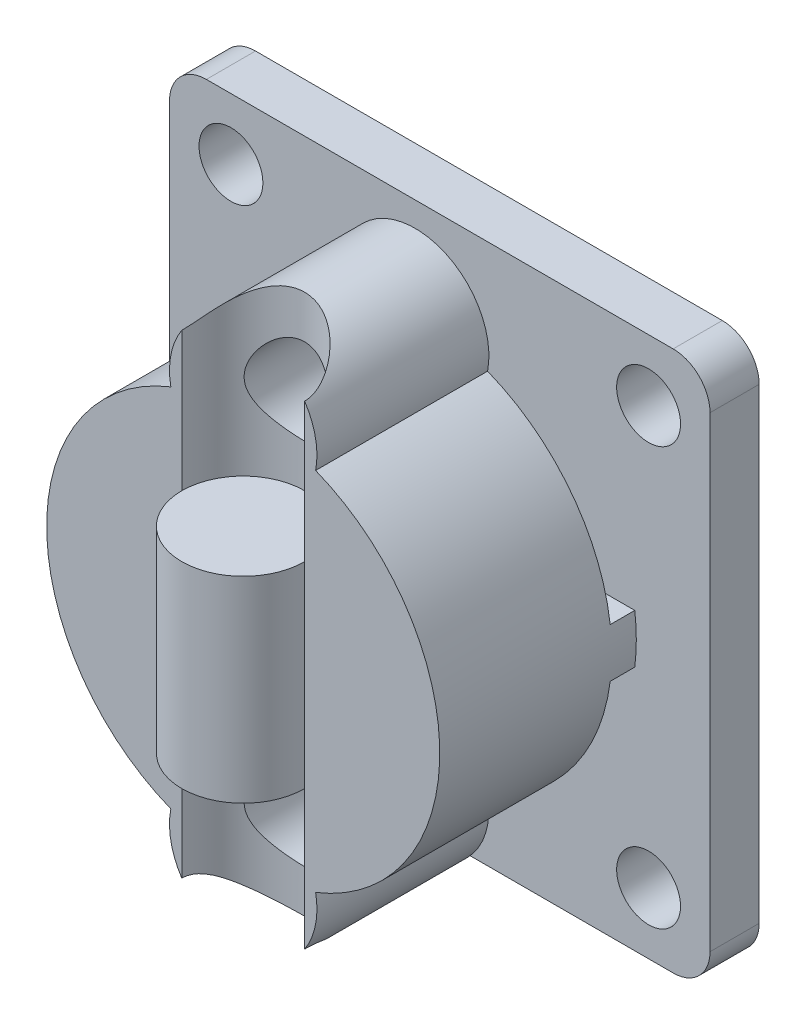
ISO-10303-21;
HEADER;
FILE_DESCRIPTION(('STEP AP214'),'2;1');
FILE_NAME('part.step','',(''),(''),'','','');
FILE_SCHEMA(('AUTOMOTIVE_DESIGN { 1 0 10303 214 1 1 1 1 }'));
ENDSEC;
DATA;
#1=APPLICATION_CONTEXT('core data for automotive mechanical design processes');
#2=APPLICATION_PROTOCOL_DEFINITION('international standard','automotive_design',2000,#1);
#3=PRODUCT_CONTEXT('',#1,'mechanical');
#4=PRODUCT('Part','Part','',(#3));
#5=PRODUCT_RELATED_PRODUCT_CATEGORY('part','',(#4));
#6=PRODUCT_DEFINITION_FORMATION('','',#4);
#7=PRODUCT_DEFINITION_CONTEXT('part definition',#1,'design');
#8=PRODUCT_DEFINITION('design','',#6,#7);
#9=PRODUCT_DEFINITION_SHAPE('','',#8);
#10=(LENGTH_UNIT() NAMED_UNIT(*) SI_UNIT(.MILLI.,.METRE.));
#11=(NAMED_UNIT(*) PLANE_ANGLE_UNIT() SI_UNIT($,.RADIAN.));
#12=(NAMED_UNIT(*) SI_UNIT($,.STERADIAN.) SOLID_ANGLE_UNIT());
#13=UNCERTAINTY_MEASURE_WITH_UNIT(LENGTH_MEASURE(1.E-05),#10,'distance_accuracy_value','');
#14=(GEOMETRIC_REPRESENTATION_CONTEXT(3) GLOBAL_UNCERTAINTY_ASSIGNED_CONTEXT((#13)) GLOBAL_UNIT_ASSIGNED_CONTEXT((#10,
#11,#12)) REPRESENTATION_CONTEXT('',''));
#15=CARTESIAN_POINT('',(0.,0.,0.));
#16=DIRECTION('',(0.,0.,1.));
#17=DIRECTION('',(1.,0.,0.));
#18=AXIS2_PLACEMENT_3D('',#15,#16,#17);
#19=CARTESIAN_POINT('',(-11.,0.,10.));
#20=DIRECTION('',(0.,1.,0.));
#21=DIRECTION('',(0.,0.,1.));
#22=AXIS2_PLACEMENT_3D('',#19,#20,#21);
#23=CYLINDRICAL_SURFACE('',#22,2.5);
#24=CARTESIAN_POINT('',(-9.24999999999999,3.5,8.21464289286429));
#25=CARTESIAN_POINT('',(-9.25000331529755,3.41599901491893,8.21463634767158));
#26=CARTESIAN_POINT('',(-9.2561047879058,3.33197956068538,8.20859698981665));
#27=CARTESIAN_POINT('',(-9.27993289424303,3.16705616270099,8.18571792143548));
#28=CARTESIAN_POINT('',(-9.29768537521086,3.08615957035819,8.16885419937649));
#29=CARTESIAN_POINT('',(-9.34329501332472,2.93048506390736,8.12750061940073));
#30=CARTESIAN_POINT('',(-9.37103873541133,2.85564957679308,8.10309679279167));
#31=CARTESIAN_POINT('',(-9.43553195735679,2.71186682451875,8.04956526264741));
#32=CARTESIAN_POINT('',(-9.47228208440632,2.64291996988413,8.02043723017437));
#33=CARTESIAN_POINT('',(-9.56121378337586,2.49965218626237,7.95464897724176));
#34=CARTESIAN_POINT('',(-9.61497070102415,2.42650460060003,7.91756299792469));
#35=CARTESIAN_POINT('',(-9.73322154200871,2.28921966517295,7.8435791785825));
#36=CARTESIAN_POINT('',(-9.79772868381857,2.22509358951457,7.80668162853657));
#37=CARTESIAN_POINT('',(-9.94855624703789,2.09703432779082,7.73003075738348));
#38=CARTESIAN_POINT('',(-10.0367203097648,2.03491185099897,7.69082521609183));
#39=CARTESIAN_POINT('',(-10.2254928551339,1.92698065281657,7.62088115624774));
#40=CARTESIAN_POINT('',(-10.326075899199,1.88113930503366,7.59012573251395));
#41=CARTESIAN_POINT('',(-10.5083583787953,1.81850529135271,7.54754062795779));
#42=CARTESIAN_POINT('',(-10.5878547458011,1.79721510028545,7.53284511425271));
#43=CARTESIAN_POINT('',(-10.7500581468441,1.76597814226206,7.5111846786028));
#44=CARTESIAN_POINT('',(-10.8327625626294,1.7560223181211,7.50421358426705));
#45=CARTESIAN_POINT('',(-10.9991940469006,1.74801408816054,7.49861106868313));
#46=CARTESIAN_POINT('',(-11.082922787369,1.74998480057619,7.49999584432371));
#47=CARTESIAN_POINT('',(-11.2487083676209,1.76576193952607,7.51101419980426));
#48=CARTESIAN_POINT('',(-11.3307647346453,1.77957166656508,7.52065007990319));
#49=CARTESIAN_POINT('',(-11.4890916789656,1.81780601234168,7.54702405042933));
#50=CARTESIAN_POINT('',(-11.5654515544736,1.84198122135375,7.56359505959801));
#51=CARTESIAN_POINT('',(-11.7128661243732,1.89981315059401,7.6025758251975));
#52=CARTESIAN_POINT('',(-11.7839197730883,1.93347173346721,7.62498672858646));
#53=CARTESIAN_POINT('',(-11.9273649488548,2.01340177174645,7.67697429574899));
#54=CARTESIAN_POINT('',(-11.9990115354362,2.06066486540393,7.7070729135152));
#55=CARTESIAN_POINT('',(-12.1338016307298,2.16424810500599,7.77063695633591));
#56=CARTESIAN_POINT('',(-12.1969358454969,2.22057800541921,7.8041059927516));
#57=CARTESIAN_POINT('',(-12.3246688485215,2.35213163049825,7.8782959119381));
#58=CARTESIAN_POINT('',(-12.3875155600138,2.42893299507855,7.91924442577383));
#59=CARTESIAN_POINT('',(-12.499862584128,2.592924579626,7.99871595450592));
#60=CARTESIAN_POINT('',(-12.5493663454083,2.68011210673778,8.03723959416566));
#61=CARTESIAN_POINT('',(-12.6237938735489,2.84286092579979,8.09866831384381));
#62=CARTESIAN_POINT('',(-12.6517550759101,2.91643790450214,8.12312427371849));
#63=CARTESIAN_POINT('',(-12.6978335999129,3.06854693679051,8.16469904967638));
#64=CARTESIAN_POINT('',(-12.7159693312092,3.14706941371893,8.18183157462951));
#65=CARTESIAN_POINT('',(-12.7413948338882,3.30829002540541,8.20615604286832));
#66=CARTESIAN_POINT('',(-12.748572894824,3.39102239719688,8.21324554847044));
#67=CARTESIAN_POINT('',(-12.7510385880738,3.55682902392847,8.21565945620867));
#68=CARTESIAN_POINT('',(-12.7463305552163,3.63990314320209,8.21098814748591));
#69=CARTESIAN_POINT('',(-12.7269623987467,3.79179069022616,8.19231239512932));
#70=CARTESIAN_POINT('',(-12.7137764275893,3.8609813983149,8.1796953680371));
#71=CARTESIAN_POINT('',(-12.679694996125,3.99596183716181,8.1482000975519));
#72=CARTESIAN_POINT('',(-12.6587914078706,4.06174789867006,8.12931525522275));
#73=CARTESIAN_POINT('',(-12.5985289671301,4.21922965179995,8.07725841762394));
#74=CARTESIAN_POINT('',(-12.5551150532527,4.30853196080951,8.04154687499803));
#75=CARTESIAN_POINT('',(-12.4549264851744,4.47742717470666,7.96600400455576));
#76=CARTESIAN_POINT('',(-12.3981257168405,4.55700063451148,7.92616471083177));
#77=CARTESIAN_POINT('',(-12.2709251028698,4.7071042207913,7.84581330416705));
#78=CARTESIAN_POINT('',(-12.2002888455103,4.77743534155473,7.8053026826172));
#79=CARTESIAN_POINT('',(-12.0469134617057,4.90586148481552,7.72814586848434));
#80=CARTESIAN_POINT('',(-11.9641923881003,4.96397444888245,7.69149404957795));
#81=CARTESIAN_POINT('',(-11.8019729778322,5.05776857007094,7.63080473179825));
#82=CARTESIAN_POINT('',(-11.7241018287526,5.09555519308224,7.60568631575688));
#83=CARTESIAN_POINT('',(-11.5618998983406,5.15962522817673,7.56252316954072));
#84=CARTESIAN_POINT('',(-11.4775730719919,5.18591561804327,7.54447414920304));
#85=CARTESIAN_POINT('',(-11.3040263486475,5.22569727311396,7.51699342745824));
#86=CARTESIAN_POINT('',(-11.2147812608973,5.23911459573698,7.5076115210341));
#87=CARTESIAN_POINT('',(-11.034805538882,5.25197498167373,7.49862172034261));
#88=CARTESIAN_POINT('',(-10.944075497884,5.25142349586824,7.49901001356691));
#89=CARTESIAN_POINT('',(-10.7730918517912,5.23714050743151,7.50898861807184));
#90=CARTESIAN_POINT('',(-10.692673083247,5.22468773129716,7.51768611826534));
#91=CARTESIAN_POINT('',(-10.5353876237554,5.18912388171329,7.54226228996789));
#92=CARTESIAN_POINT('',(-10.4585216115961,5.16601078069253,7.55814232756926));
#93=CARTESIAN_POINT('',(-10.3073699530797,5.10919676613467,7.59655232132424));
#94=CARTESIAN_POINT('',(-10.2332688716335,5.07515348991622,7.61929563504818));
#95=CARTESIAN_POINT('',(-10.0917595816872,4.99803220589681,7.66960361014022));
#96=CARTESIAN_POINT('',(-10.0243526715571,4.95495245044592,7.6971692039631));
#97=CARTESIAN_POINT('',(-9.88689475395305,4.85347546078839,7.76000883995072));
#98=CARTESIAN_POINT('',(-9.81807867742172,4.79373638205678,7.79581422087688));
#99=CARTESIAN_POINT('',(-9.69075017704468,4.6647319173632,7.86897339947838));
#100=CARTESIAN_POINT('',(-9.63225977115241,4.59544672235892,7.90633030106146));
#101=CARTESIAN_POINT('',(-9.51795288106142,4.43652799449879,7.98528696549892));
#102=CARTESIAN_POINT('',(-9.46400396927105,4.34540799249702,8.0266298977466));
#103=CARTESIAN_POINT('',(-9.37262241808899,4.15227949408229,8.10128186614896));
#104=CARTESIAN_POINT('',(-9.3351397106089,4.05030519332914,8.13461511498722));
#105=CARTESIAN_POINT('',(-9.28857220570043,3.87273469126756,8.17745522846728));
#106=CARTESIAN_POINT('',(-9.27419594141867,3.79956150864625,8.19119581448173));
#107=CARTESIAN_POINT('',(-9.25491663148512,3.6509276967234,8.20978481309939));
#108=CARTESIAN_POINT('',(-9.24999702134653,3.57547130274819,8.21464877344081));
#109=CARTESIAN_POINT('',(-9.24999999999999,3.5,8.21464289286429));
#110=B_SPLINE_CURVE_WITH_KNOTS('',3,(#24,#25,#26,#27,#28,#29,#30,#31,#32,#33,#34,#35,#36,#37,
#38,#39,#40,#41,#42,#43,#44,#45,#46,#47,#48,#49,#50,#51,#52,#53,#54,#55,#56,#57,#58,#59,#60,#61,
#62,#63,#64,#65,#66,#67,#68,#69,#70,#71,#72,#73,#74,#75,#76,#77,#78,#79,#80,#81,#82,#83,#84,#85,
#86,#87,#88,#89,#90,#91,#92,#93,#94,#95,#96,#97,#98,#99,#100,#101,#102,#103,#104,#105,#106,#107,
#108,#109),.UNSPECIFIED.,.T.,.F.,(4,2,2,2,2,2,2,2,2,2,2,2,2,2,2,2,2,2,2,2,2,2,2,2,2,2,2,2,2,2,2,
2,2,2,2,2,2,2,2,2,2,2,4),(0.,0.251644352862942,0.503848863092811,0.753275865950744,
1.00272024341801,1.29584807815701,1.5893390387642,1.93170814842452,2.27338724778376,
2.52311133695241,2.77263573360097,3.02264395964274,3.27272190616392,3.51709337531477,
3.76151287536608,4.03336573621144,4.30551304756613,4.62626324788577,4.94693046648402,
5.19332741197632,5.43926108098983,5.68768561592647,5.93601956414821,6.14983844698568,
6.36388316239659,6.67875939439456,6.99425502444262,7.31570467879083,7.63667895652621,
7.90595122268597,8.17505982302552,8.44570508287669,8.71624473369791,8.96064229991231,
9.20508636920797,9.45808878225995,9.71114017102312,10.003763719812,10.2970038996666,
10.6363668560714,10.9746906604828,11.201179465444,11.427271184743),.UNSPECIFIED.);
#111=CARTESIAN_POINT('',(-9.24999999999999,3.5,8.21464289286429));
#112=VERTEX_POINT('',#111);
#113=EDGE_CURVE('E277',#112,#112,#110,.T.);
#114=ORIENTED_EDGE('',*,*,#113,.T.);
#115=EDGE_LOOP('',(#114));
#116=FACE_BOUND('',#115,.T.);
#117=CARTESIAN_POINT('',(-11.,7.,10.));
#118=DIRECTION('',(0.,1.,0.));
#119=DIRECTION('',(0.,0.,1.));
#120=AXIS2_PLACEMENT_3D('',#117,#118,#119);
#121=CIRCLE('',#120,2.5);
#122=CARTESIAN_POINT('',(-8.5,7.,10.));
#123=VERTEX_POINT('',#122);
#124=CARTESIAN_POINT('',(-13.5,7.,10.));
#125=VERTEX_POINT('',#124);
#126=EDGE_CURVE('E49',#123,#125,#121,.T.);
#127=ORIENTED_EDGE('',*,*,#126,.T.);
#128=DIRECTION('',(0.,1.,0.));
#129=VECTOR('',#128,1.);
#130=CARTESIAN_POINT('',(-13.5,0.,10.));
#131=LINE('',#130,#129);
#132=CARTESIAN_POINT('',(-13.5,1.3416876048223,10.));
#133=VERTEX_POINT('',#132);
#134=EDGE_CURVE('E662',#125,#133,#131,.F.);
#135=ORIENTED_EDGE('',*,*,#134,.T.);
#136=CARTESIAN_POINT('',(-8.5,1.3416876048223,10.));
#137=CARTESIAN_POINT('',(-8.49998946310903,1.34171976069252,9.95533238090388));
#138=CARTESIAN_POINT('',(-8.5011966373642,1.3398837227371,9.91068532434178));
#139=CARTESIAN_POINT('',(-8.50596054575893,1.33272682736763,9.82188119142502));
#140=CARTESIAN_POINT('',(-8.50951275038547,1.3274126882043,9.77772333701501));
#141=CARTESIAN_POINT('',(-8.51881276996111,1.31365101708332,9.69081344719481));
#142=CARTESIAN_POINT('',(-8.52452762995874,1.30525056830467,9.64805029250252));
#143=CARTESIAN_POINT('',(-8.53803168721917,1.28569098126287,9.56348315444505));
#144=CARTESIAN_POINT('',(-8.5458220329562,1.27453031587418,9.5216797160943));
#145=CARTESIAN_POINT('',(-8.57905430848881,1.22777305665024,9.36527357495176));
#146=CARTESIAN_POINT('',(-8.61111734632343,1.18421753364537,9.25440900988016));
#147=CARTESIAN_POINT('',(-8.6882969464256,1.08690941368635,9.04133278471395));
#148=CARTESIAN_POINT('',(-8.73352212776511,1.03307330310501,8.93920266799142));
#149=CARTESIAN_POINT('',(-8.82154860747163,0.936661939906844,8.77091282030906));
#150=CARTESIAN_POINT('',(-8.86152160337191,0.895122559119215,8.7026527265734));
#151=CARTESIAN_POINT('',(-8.94746839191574,0.811226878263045,8.57054783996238));
#152=CARTESIAN_POINT('',(-8.99344471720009,0.768870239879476,8.50670492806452));
#153=CARTESIAN_POINT('',(-9.14007664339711,0.642620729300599,8.32209953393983));
#154=CARTESIAN_POINT('',(-9.24967833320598,0.559266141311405,8.20779776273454));
#155=CARTESIAN_POINT('',(-9.46667683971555,0.4189233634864,8.0214151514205));
#156=CARTESIAN_POINT('',(-9.56962819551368,0.360089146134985,7.94551882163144));
#157=CARTESIAN_POINT('',(-9.78970064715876,0.252253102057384,7.80867666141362));
#158=CARTESIAN_POINT('',(-9.90680156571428,0.203237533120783,7.74770990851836));
#159=CARTESIAN_POINT('',(-10.1320711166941,0.126270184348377,7.6528864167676));
#160=CARTESIAN_POINT('',(-10.2382829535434,0.0961416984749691,7.61616482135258));
#161=CARTESIAN_POINT('',(-10.4571695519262,0.0473955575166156,7.55701885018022));
#162=CARTESIAN_POINT('',(-10.5698403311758,0.0287708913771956,7.53458576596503));
#163=CARTESIAN_POINT('',(-10.7990937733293,0.00450840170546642,7.50539850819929));
#164=CARTESIAN_POINT('',(-10.9156908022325,-0.00107488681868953,7.49871017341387));
#165=CARTESIAN_POINT('',(-11.1485273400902,0.00141856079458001,7.50170224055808));
#166=CARTESIAN_POINT('',(-11.2647668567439,0.00949500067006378,7.51138228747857));
#167=CARTESIAN_POINT('',(-11.4854457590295,0.0375866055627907,7.54521420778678));
#168=CARTESIAN_POINT('',(-11.5901534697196,0.0567639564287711,7.56835099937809));
#169=CARTESIAN_POINT('',(-11.7936257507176,0.104986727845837,7.62694764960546));
#170=CARTESIAN_POINT('',(-11.8923894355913,0.134033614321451,7.6624093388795));
#171=CARTESIAN_POINT('',(-12.0905341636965,0.203097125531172,7.74759139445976));
#172=CARTESIAN_POINT('',(-12.1892447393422,0.243839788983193,7.79827228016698));
#173=CARTESIAN_POINT('',(-12.3767800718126,0.332552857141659,7.91039730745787));
#174=CARTESIAN_POINT('',(-12.4655959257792,0.380529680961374,7.97185101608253));
#175=CARTESIAN_POINT('',(-12.6728036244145,0.505511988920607,8.13545919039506));
#176=CARTESIAN_POINT('',(-12.7851738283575,0.585471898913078,8.24307095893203));
#177=CARTESIAN_POINT('',(-12.9367015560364,0.707960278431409,8.41723986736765));
#178=CARTESIAN_POINT('',(-12.9844271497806,0.749273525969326,8.4775138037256));
#179=CARTESIAN_POINT('',(-13.0741868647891,0.831716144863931,8.60227177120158));
#180=CARTESIAN_POINT('',(-13.1162230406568,0.872845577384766,8.66675426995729));
#181=CARTESIAN_POINT('',(-13.2128219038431,0.97263331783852,8.83110709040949));
#182=CARTESIAN_POINT('',(-13.2640644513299,1.03050586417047,8.93343837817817));
#183=CARTESIAN_POINT('',(-13.3531315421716,1.13784941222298,9.14783771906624));
#184=CARTESIAN_POINT('',(-13.390991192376,1.18734221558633,9.25987932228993));
#185=CARTESIAN_POINT('',(-13.4418792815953,1.2568747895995,9.45763187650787));
#186=CARTESIAN_POINT('',(-13.458967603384,1.28128825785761,9.54072143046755));
#187=CARTESIAN_POINT('',(-13.4846653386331,1.31863921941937,9.71061722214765));
#188=CARTESIAN_POINT('',(-13.4933065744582,1.33161976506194,9.79740821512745));
#189=CARTESIAN_POINT('',(-13.4982281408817,1.33901988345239,9.90392747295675));
#190=CARTESIAN_POINT('',(-13.4988919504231,1.34001859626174,9.92311851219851));
#191=CARTESIAN_POINT('',(-13.499777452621,1.34135153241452,9.96153766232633));
#192=CARTESIAN_POINT('',(-13.4999990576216,1.34168562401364,9.98076577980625));
#193=CARTESIAN_POINT('',(-13.5,1.3416876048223,10.));
#194=B_SPLINE_CURVE_WITH_KNOTS('',3,(#136,#137,#138,#139,#140,#141,#142,#143,#144,#145,#146,
#147,#148,#149,#150,#151,#152,#153,#154,#155,#156,#157,#158,#159,#160,#161,#162,#163,#164,#165,
#166,#167,#168,#169,#170,#171,#172,#173,#174,#175,#176,#177,#178,#179,#180,#181,#182,#183,#184,
#185,#186,#187,#188,#189,#190,#191,#192,#193),.UNSPECIFIED.,.F.,.F.,(4,2,2,2,2,2,2,2,2,2,2,2,2,
2,2,2,2,2,2,2,2,2,2,2,2,2,2,2,4),(0.,0.133915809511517,0.267573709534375,0.399271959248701,
0.531043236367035,0.898867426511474,1.26981755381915,1.53753000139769,1.8053557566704,
2.33924592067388,2.76010881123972,3.18037848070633,3.52797653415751,3.87536253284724,
4.22419861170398,4.57302712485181,4.89843954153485,5.22390031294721,5.57721326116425,
5.93084158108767,6.45264424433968,6.71427180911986,6.97580463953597,7.35949670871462,
7.74217465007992,8.00607441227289,8.26897611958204,8.32665105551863,8.38433742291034),.UNSPECIFIED.);
#195=CARTESIAN_POINT('',(-8.5,1.3416876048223,10.));
#196=VERTEX_POINT('',#195);
#197=EDGE_CURVE('E189',#196,#133,#194,.T.);
#198=ORIENTED_EDGE('',*,*,#197,.F.);
#199=DIRECTION('',(0.,1.,0.));
#200=VECTOR('',#199,1.);
#201=CARTESIAN_POINT('',(-8.5,0.,10.));
#202=LINE('',#201,#200);
#203=EDGE_CURVE('E186',#196,#123,#202,.T.);
#204=ORIENTED_EDGE('',*,*,#203,.T.);
#205=EDGE_LOOP('',(#127,#135,#198,#204));
#206=FACE_BOUND('',#205,.T.);
#207=ADVANCED_FACE('F26',(#116,#206),#23,.F.);
#208=CARTESIAN_POINT('',(0.,12.,2.));
#209=DIRECTION('',(0.,-1.,0.));
#210=DIRECTION('',(1.,0.,0.));
#211=AXIS2_PLACEMENT_3D('',#208,#209,#210);
#212=PLANE('',#211);
#213=DIRECTION('',(-1.,0.,0.));
#214=VECTOR('',#213,1.);
#215=CARTESIAN_POINT('',(0.,12.,3.));
#216=LINE('',#215,#214);
#217=CARTESIAN_POINT('',(-12.7320508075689,12.,3.));
#218=VERTEX_POINT('',#217);
#219=CARTESIAN_POINT('',(-18.9372539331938,12.,3.));
#220=VERTEX_POINT('',#219);
#221=EDGE_CURVE('E392',#218,#220,#216,.T.);
#222=ORIENTED_EDGE('',*,*,#221,.F.);
#223=DIRECTION('',(0.,0.,-1.));
#224=VECTOR('',#223,1.);
#225=CARTESIAN_POINT('',(-12.7320508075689,12.,10.1816689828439));
#226=LINE('',#225,#224);
#227=CARTESIAN_POINT('',(-12.7320508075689,12.,2.));
#228=VERTEX_POINT('',#227);
#229=EDGE_CURVE('E234',#218,#228,#226,.T.);
#230=ORIENTED_EDGE('',*,*,#229,.T.);
#231=DIRECTION('',(-1.,0.,0.));
#232=VECTOR('',#231,1.);
#233=CARTESIAN_POINT('',(0.,12.,2.));
#234=LINE('',#233,#232);
#235=CARTESIAN_POINT('',(-18.9372539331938,12.,2.));
#236=VERTEX_POINT('',#235);
#237=EDGE_CURVE('E404',#228,#236,#234,.T.);
#238=ORIENTED_EDGE('',*,*,#237,.T.);
#239=DIRECTION('',(0.,0.,-1.));
#240=VECTOR('',#239,1.);
#241=CARTESIAN_POINT('',(-18.9372539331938,12.,10.));
#242=LINE('',#241,#240);
#243=EDGE_CURVE('E395',#220,#236,#242,.T.);
#244=ORIENTED_EDGE('',*,*,#243,.F.);
#245=EDGE_LOOP('',(#222,#230,#238,#244));
#246=FACE_BOUND('',#245,.T.);
#247=ADVANCED_FACE('F318',(#246),#212,.F.);
#248=CARTESIAN_POINT('',(0.,10.,2.));
#249=DIRECTION('',(0.,1.,0.));
#250=DIRECTION('',(-1.,0.,0.));
#251=AXIS2_PLACEMENT_3D('',#248,#249,#250);
#252=PLANE('',#251);
#253=DIRECTION('',(-1.,0.,0.));
#254=VECTOR('',#253,1.);
#255=CARTESIAN_POINT('',(0.,10.,3.));
#256=LINE('',#255,#254);
#257=CARTESIAN_POINT('',(-3.06274606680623,10.,3.));
#258=VERTEX_POINT('',#257);
#259=CARTESIAN_POINT('',(-9.26794919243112,10.,3.));
#260=VERTEX_POINT('',#259);
#261=EDGE_CURVE('E584',#258,#260,#256,.T.);
#262=ORIENTED_EDGE('',*,*,#261,.T.);
#263=DIRECTION('',(0.,0.,-1.));
#264=VECTOR('',#263,1.);
#265=CARTESIAN_POINT('',(-9.26794919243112,10.,10.1816689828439));
#266=LINE('',#265,#264);
#267=CARTESIAN_POINT('',(-9.26794919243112,10.,2.));
#268=VERTEX_POINT('',#267);
#269=EDGE_CURVE('E222',#260,#268,#266,.T.);
#270=ORIENTED_EDGE('',*,*,#269,.T.);
#271=DIRECTION('',(-1.,0.,0.));
#272=VECTOR('',#271,1.);
#273=CARTESIAN_POINT('',(0.,10.,2.));
#274=LINE('',#273,#272);
#275=CARTESIAN_POINT('',(-3.06274606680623,10.,2.));
#276=VERTEX_POINT('',#275);
#277=EDGE_CURVE('E587',#276,#268,#274,.T.);
#278=ORIENTED_EDGE('',*,*,#277,.F.);
#279=DIRECTION('',(0.,0.,-1.));
#280=VECTOR('',#279,1.);
#281=CARTESIAN_POINT('',(-3.06274606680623,10.,10.));
#282=LINE('',#281,#280);
#283=EDGE_CURVE('E407',#258,#276,#282,.T.);
#284=ORIENTED_EDGE('',*,*,#283,.F.);
#285=EDGE_LOOP('',(#262,#270,#278,#284));
#286=FACE_BOUND('',#285,.T.);
#287=ADVANCED_FACE('F306',(#286),#252,.F.);
#288=CARTESIAN_POINT('',(-11.,11.,-2.));
#289=DIRECTION('',(0.,0.,-1.));
#290=DIRECTION('',(-1.,0.,0.));
#291=AXIS2_PLACEMENT_3D('',#288,#289,#290);
#292=PLANE('',#291);
#293=CARTESIAN_POINT('',(-11.,18.5,-2.));
#294=DIRECTION('',(0.,0.,1.));
#295=DIRECTION('',(1.,0.,0.));
#296=AXIS2_PLACEMENT_3D('',#293,#294,#295);
#297=CIRCLE('',#296,0.799999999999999);
#298=CARTESIAN_POINT('',(-10.2,18.5,-2.));
#299=VERTEX_POINT('',#298);
#300=EDGE_CURVE('E599',#299,#299,#297,.T.);
#301=ORIENTED_EDGE('',*,*,#300,.T.);
#302=EDGE_LOOP('',(#301));
#303=FACE_BOUND('',#302,.T.);
#304=CARTESIAN_POINT('',(-11.,11.,-2.));
#305=DIRECTION('',(0.,0.,-1.));
#306=DIRECTION('',(-1.,0.,0.));
#307=AXIS2_PLACEMENT_3D('',#304,#305,#306);
#308=CIRCLE('',#307,6.2);
#309=CARTESIAN_POINT('',(-17.2,11.,-2.));
#310=VERTEX_POINT('',#309);
#311=EDGE_CURVE('E558',#310,#310,#308,.F.);
#312=ORIENTED_EDGE('',*,*,#311,.T.);
#313=EDGE_LOOP('',(#312));
#314=FACE_BOUND('',#313,.T.);
#315=CARTESIAN_POINT('',(-11.,11.,-2.));
#316=DIRECTION('',(0.,0.,-1.));
#317=DIRECTION('',(-1.,0.,0.));
#318=AXIS2_PLACEMENT_3D('',#315,#316,#317);
#319=CIRCLE('',#318,8.8);
#320=CARTESIAN_POINT('',(-19.8,11.,-2.));
#321=VERTEX_POINT('',#320);
#322=EDGE_CURVE('E555',#321,#321,#319,.T.);
#323=ORIENTED_EDGE('',*,*,#322,.T.);
#324=EDGE_LOOP('',(#323));
#325=FACE_BOUND('',#324,.T.);
#326=CARTESIAN_POINT('',(-11.,3.5,-2.));
#327=DIRECTION('',(0.,0.,1.));
#328=DIRECTION('',(1.,0.,0.));
#329=AXIS2_PLACEMENT_3D('',#326,#327,#328);
#330=CIRCLE('',#329,0.799999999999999);
#331=CARTESIAN_POINT('',(-10.2,3.5,-2.));
#332=VERTEX_POINT('',#331);
#333=EDGE_CURVE('E612',#332,#332,#330,.T.);
#334=ORIENTED_EDGE('',*,*,#333,.T.);
#335=EDGE_LOOP('',(#334));
#336=FACE_BOUND('',#335,.T.);
#337=ADVANCED_FACE('F332',(#303,#314,#325,#336),#292,.T.);
#338=CARTESIAN_POINT('',(-22.,0.,0.));
#339=DIRECTION('',(0.,0.,1.));
#340=DIRECTION('',(1.,0.,0.));
#341=AXIS2_PLACEMENT_3D('',#338,#339,#340);
#342=PLANE('',#341);
#343=CARTESIAN_POINT('',(-19.5,2.5,0.));
#344=DIRECTION('',(0.,0.,1.));
#345=DIRECTION('',(1.,0.,0.));
#346=AXIS2_PLACEMENT_3D('',#343,#344,#345);
#347=CIRCLE('',#346,1.3);
#348=CARTESIAN_POINT('',(-18.2,2.5,0.));
#349=VERTEX_POINT('',#348);
#350=EDGE_CURVE('E421',#349,#349,#347,.T.);
#351=ORIENTED_EDGE('',*,*,#350,.T.);
#352=EDGE_LOOP('',(#351));
#353=FACE_BOUND('',#352,.T.);
#354=CARTESIAN_POINT('',(-2.5,2.5,0.));
#355=DIRECTION('',(0.,0.,1.));
#356=DIRECTION('',(1.,0.,0.));
#357=AXIS2_PLACEMENT_3D('',#354,#355,#356);
#358=CIRCLE('',#357,1.3);
#359=CARTESIAN_POINT('',(-1.2,2.5,0.));
#360=VERTEX_POINT('',#359);
#361=EDGE_CURVE('E427',#360,#360,#358,.T.);
#362=ORIENTED_EDGE('',*,*,#361,.T.);
#363=EDGE_LOOP('',(#362));
#364=FACE_BOUND('',#363,.T.);
#365=CARTESIAN_POINT('',(-19.5,19.5,0.));
#366=DIRECTION('',(0.,0.,1.));
#367=DIRECTION('',(1.,0.,0.));
#368=AXIS2_PLACEMENT_3D('',#365,#366,#367);
#369=CIRCLE('',#368,1.3);
#370=CARTESIAN_POINT('',(-18.2,19.5,0.));
#371=VERTEX_POINT('',#370);
#372=EDGE_CURVE('E433',#371,#371,#369,.T.);
#373=ORIENTED_EDGE('',*,*,#372,.T.);
#374=EDGE_LOOP('',(#373));
#375=FACE_BOUND('',#374,.T.);
#376=CARTESIAN_POINT('',(-2.5,19.5,0.));
#377=DIRECTION('',(0.,0.,1.));
#378=DIRECTION('',(1.,0.,0.));
#379=AXIS2_PLACEMENT_3D('',#376,#377,#378);
#380=CIRCLE('',#379,1.3);
#381=CARTESIAN_POINT('',(-1.2,19.5,0.));
#382=VERTEX_POINT('',#381);
#383=EDGE_CURVE('E439',#382,#382,#380,.T.);
#384=ORIENTED_EDGE('',*,*,#383,.T.);
#385=EDGE_LOOP('',(#384));
#386=FACE_BOUND('',#385,.T.);
#387=DIRECTION('',(1.,0.,0.));
#388=VECTOR('',#387,1.);
#389=CARTESIAN_POINT('',(-22.,0.,0.));
#390=LINE('',#389,#388);
#391=CARTESIAN_POINT('',(-20.5,0.,0.));
#392=VERTEX_POINT('',#391);
#393=CARTESIAN_POINT('',(-1.5,0.,0.));
#394=VERTEX_POINT('',#393);
#395=EDGE_CURVE('E708',#392,#394,#390,.T.);
#396=ORIENTED_EDGE('',*,*,#395,.F.);
#397=CARTESIAN_POINT('',(-20.5,1.5,0.));
#398=DIRECTION('',(0.,0.,1.));
#399=DIRECTION('',(1.,0.,0.));
#400=AXIS2_PLACEMENT_3D('',#397,#398,#399);
#401=CIRCLE('',#400,1.5);
#402=CARTESIAN_POINT('',(-22.,1.5,0.));
#403=VERTEX_POINT('',#402);
#404=EDGE_CURVE('E517',#392,#403,#401,.F.);
#405=ORIENTED_EDGE('',*,*,#404,.T.);
#406=DIRECTION('',(0.,-1.,0.));
#407=VECTOR('',#406,1.);
#408=CARTESIAN_POINT('',(-22.,22.,0.));
#409=LINE('',#408,#407);
#410=CARTESIAN_POINT('',(-22.,20.5,0.));
#411=VERTEX_POINT('',#410);
#412=EDGE_CURVE('E715',#411,#403,#409,.T.);
#413=ORIENTED_EDGE('',*,*,#412,.F.);
#414=CARTESIAN_POINT('',(-20.5,20.5,0.));
#415=DIRECTION('',(0.,0.,1.));
#416=DIRECTION('',(1.,0.,0.));
#417=AXIS2_PLACEMENT_3D('',#414,#415,#416);
#418=CIRCLE('',#417,1.5);
#419=CARTESIAN_POINT('',(-20.5,22.,0.));
#420=VERTEX_POINT('',#419);
#421=EDGE_CURVE('E525',#411,#420,#418,.F.);
#422=ORIENTED_EDGE('',*,*,#421,.T.);
#423=DIRECTION('',(-1.,0.,0.));
#424=VECTOR('',#423,1.);
#425=CARTESIAN_POINT('',(-22.,22.,0.));
#426=LINE('',#425,#424);
#427=CARTESIAN_POINT('',(-1.5,22.,0.));
#428=VERTEX_POINT('',#427);
#429=EDGE_CURVE('E718',#428,#420,#426,.T.);
#430=ORIENTED_EDGE('',*,*,#429,.F.);
#431=CARTESIAN_POINT('',(-1.5,20.5,0.));
#432=DIRECTION('',(0.,0.,1.));
#433=DIRECTION('',(1.,0.,0.));
#434=AXIS2_PLACEMENT_3D('',#431,#432,#433);
#435=CIRCLE('',#434,1.5);
#436=CARTESIAN_POINT('',(0.,20.5,0.));
#437=VERTEX_POINT('',#436);
#438=EDGE_CURVE('E518',#428,#437,#435,.F.);
#439=ORIENTED_EDGE('',*,*,#438,.T.);
#440=DIRECTION('',(0.,1.,0.));
#441=VECTOR('',#440,1.);
#442=CARTESIAN_POINT('',(0.,22.,0.));
#443=LINE('',#442,#441);
#444=CARTESIAN_POINT('',(0.,1.5,0.));
#445=VERTEX_POINT('',#444);
#446=EDGE_CURVE('E714',#445,#437,#443,.T.);
#447=ORIENTED_EDGE('',*,*,#446,.F.);
#448=CARTESIAN_POINT('',(-1.5,1.5,0.));
#449=DIRECTION('',(0.,0.,1.));
#450=DIRECTION('',(1.,0.,0.));
#451=AXIS2_PLACEMENT_3D('',#448,#449,#450);
#452=CIRCLE('',#451,1.5);
#453=EDGE_CURVE('E520',#445,#394,#452,.F.);
#454=ORIENTED_EDGE('',*,*,#453,.T.);
#455=EDGE_LOOP('',(#396,#405,#413,#422,#430,#439,#447,#454));
#456=FACE_BOUND('',#455,.T.);
#457=CARTESIAN_POINT('',(-11.,11.,0.));
#458=DIRECTION('',(0.,0.,1.));
#459=DIRECTION('',(1.,0.,0.));
#460=AXIS2_PLACEMENT_3D('',#457,#458,#459);
#461=CIRCLE('',#460,9.);
#462=CARTESIAN_POINT('',(-2.,11.,0.));
#463=VERTEX_POINT('',#462);
#464=EDGE_CURVE('E549',#463,#463,#461,.F.);
#465=ORIENTED_EDGE('',*,*,#464,.F.);
#466=EDGE_LOOP('',(#465));
#467=FACE_BOUND('',#466,.T.);
#468=ADVANCED_FACE('F335',(#353,#364,#375,#386,#456,#467),#342,.F.);
#469=CARTESIAN_POINT('',(-11.,15.,10.));
#470=DIRECTION('',(0.,0.,1.));
#471=DIRECTION('',(1.,0.,0.));
#472=AXIS2_PLACEMENT_3D('',#469,#470,#471);
#473=PLANE('',#472);
#474=ORIENTED_EDGE('',*,*,#203,.F.);
#475=CARTESIAN_POINT('',(-11.,3.,10.));
#476=DIRECTION('',(0.,0.,1.));
#477=DIRECTION('',(1.,0.,0.));
#478=AXIS2_PLACEMENT_3D('',#475,#476,#477);
#479=CIRCLE('',#478,3.);
#480=CARTESIAN_POINT('',(-8.05320619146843,3.5625,10.));
#481=VERTEX_POINT('',#480);
#482=EDGE_CURVE('E734',#196,#481,#479,.T.);
#483=ORIENTED_EDGE('',*,*,#482,.T.);
#484=CARTESIAN_POINT('',(-11.,11.,10.));
#485=DIRECTION('',(0.,0.,1.));
#486=DIRECTION('',(1.,0.,0.));
#487=AXIS2_PLACEMENT_3D('',#484,#485,#486);
#488=CIRCLE('',#487,8.);
#489=CARTESIAN_POINT('',(-8.05320619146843,18.4375,10.));
#490=VERTEX_POINT('',#489);
#491=EDGE_CURVE('E753',#481,#490,#488,.T.);
#492=ORIENTED_EDGE('',*,*,#491,.T.);
#493=CARTESIAN_POINT('',(-11.,19.,10.));
#494=DIRECTION('',(0.,0.,1.));
#495=DIRECTION('',(1.,0.,0.));
#496=AXIS2_PLACEMENT_3D('',#493,#494,#495);
#497=CIRCLE('',#496,3.);
#498=CARTESIAN_POINT('',(-8.5,20.6583123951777,10.));
#499=VERTEX_POINT('',#498);
#500=EDGE_CURVE('E750',#490,#499,#497,.T.);
#501=ORIENTED_EDGE('',*,*,#500,.T.);
#502=CARTESIAN_POINT('',(-8.5,15.,10.));
#503=VERTEX_POINT('',#502);
#504=EDGE_CURVE('E193',#503,#499,#202,.T.);
#505=ORIENTED_EDGE('',*,*,#504,.F.);
#506=DIRECTION('',(0.,-1.,0.));
#507=VECTOR('',#506,1.);
#508=CARTESIAN_POINT('',(-8.5,15.,10.));
#509=LINE('',#508,#507);
#510=EDGE_CURVE('E196',#503,#123,#509,.T.);
#511=ORIENTED_EDGE('',*,*,#510,.T.);
#512=EDGE_LOOP('',(#474,#483,#492,#501,#505,#511));
#513=FACE_BOUND('',#512,.T.);
#514=ADVANCED_FACE('F198',(#513),#473,.T.);
#515=CARTESIAN_POINT('',(-22.,22.,2.));
#516=DIRECTION('',(1.,0.,0.));
#517=DIRECTION('',(0.,1.,0.));
#518=AXIS2_PLACEMENT_3D('',#515,#516,#517);
#519=PLANE('',#518);
#520=ORIENTED_EDGE('',*,*,#412,.T.);
#521=DIRECTION('',(0.,0.,-1.));
#522=VECTOR('',#521,1.);
#523=CARTESIAN_POINT('',(-22.,1.5,2.));
#524=LINE('',#523,#522);
#525=CARTESIAN_POINT('',(-22.,1.5,2.));
#526=VERTEX_POINT('',#525);
#527=EDGE_CURVE('E531',#403,#526,#524,.F.);
#528=ORIENTED_EDGE('',*,*,#527,.T.);
#529=DIRECTION('',(0.,-1.,0.));
#530=VECTOR('',#529,1.);
#531=CARTESIAN_POINT('',(-22.,22.,2.));
#532=LINE('',#531,#530);
#533=CARTESIAN_POINT('',(-22.,20.5,2.));
#534=VERTEX_POINT('',#533);
#535=EDGE_CURVE('E506',#534,#526,#532,.T.);
#536=ORIENTED_EDGE('',*,*,#535,.F.);
#537=DIRECTION('',(0.,0.,-1.));
#538=VECTOR('',#537,1.);
#539=CARTESIAN_POINT('',(-22.,20.5,2.));
#540=LINE('',#539,#538);
#541=EDGE_CURVE('E528',#534,#411,#540,.T.);
#542=ORIENTED_EDGE('',*,*,#541,.T.);
#543=EDGE_LOOP('',(#520,#528,#536,#542));
#544=FACE_BOUND('',#543,.T.);
#545=ADVANCED_FACE('F28',(#544),#519,.F.);
#546=CARTESIAN_POINT('',(-22.,0.,2.));
#547=DIRECTION('',(0.,1.,0.));
#548=DIRECTION('',(0.,0.,1.));
#549=AXIS2_PLACEMENT_3D('',#546,#547,#548);
#550=PLANE('',#549);
#551=DIRECTION('',(1.,0.,0.));
#552=VECTOR('',#551,1.);
#553=CARTESIAN_POINT('',(-22.,0.,2.));
#554=LINE('',#553,#552);
#555=CARTESIAN_POINT('',(-20.5,0.,2.));
#556=VERTEX_POINT('',#555);
#557=CARTESIAN_POINT('',(-1.5,0.,2.));
#558=VERTEX_POINT('',#557);
#559=EDGE_CURVE('E496',#556,#558,#554,.T.);
#560=ORIENTED_EDGE('',*,*,#559,.F.);
#561=DIRECTION('',(0.,0.,-1.));
#562=VECTOR('',#561,1.);
#563=CARTESIAN_POINT('',(-20.5,0.,2.));
#564=LINE('',#563,#562);
#565=EDGE_CURVE('E500',#556,#392,#564,.T.);
#566=ORIENTED_EDGE('',*,*,#565,.T.);
#567=ORIENTED_EDGE('',*,*,#395,.T.);
#568=DIRECTION('',(0.,0.,-1.));
#569=VECTOR('',#568,1.);
#570=CARTESIAN_POINT('',(-1.5,0.,2.));
#571=LINE('',#570,#569);
#572=EDGE_CURVE('E192',#394,#558,#571,.F.);
#573=ORIENTED_EDGE('',*,*,#572,.T.);
#574=EDGE_LOOP('',(#560,#566,#567,#573));
#575=FACE_BOUND('',#574,.T.);
#576=ADVANCED_FACE('F486',(#575),#550,.F.);
#577=CARTESIAN_POINT('',(0.,22.,2.));
#578=DIRECTION('',(-1.,0.,0.));
#579=DIRECTION('',(0.,-1.,0.));
#580=AXIS2_PLACEMENT_3D('',#577,#578,#579);
#581=PLANE('',#580);
#582=DIRECTION('',(0.,1.,0.));
#583=VECTOR('',#582,1.);
#584=CARTESIAN_POINT('',(0.,22.,2.));
#585=LINE('',#584,#583);
#586=CARTESIAN_POINT('',(0.,1.5,2.));
#587=VERTEX_POINT('',#586);
#588=CARTESIAN_POINT('',(0.,20.5,2.));
#589=VERTEX_POINT('',#588);
#590=EDGE_CURVE('E505',#587,#589,#585,.T.);
#591=ORIENTED_EDGE('',*,*,#590,.F.);
#592=DIRECTION('',(0.,0.,-1.));
#593=VECTOR('',#592,1.);
#594=CARTESIAN_POINT('',(0.,1.5,2.));
#595=LINE('',#594,#593);
#596=EDGE_CURVE('E541',#587,#445,#595,.T.);
#597=ORIENTED_EDGE('',*,*,#596,.T.);
#598=ORIENTED_EDGE('',*,*,#446,.T.);
#599=DIRECTION('',(0.,0.,-1.));
#600=VECTOR('',#599,1.);
#601=CARTESIAN_POINT('',(0.,20.5,2.));
#602=LINE('',#601,#600);
#603=EDGE_CURVE('E538',#437,#589,#602,.F.);
#604=ORIENTED_EDGE('',*,*,#603,.T.);
#605=EDGE_LOOP('',(#591,#597,#598,#604));
#606=FACE_BOUND('',#605,.T.);
#607=ADVANCED_FACE('F483',(#606),#581,.F.);
#608=CARTESIAN_POINT('',(-22.,22.,2.));
#609=DIRECTION('',(0.,-1.,0.));
#610=DIRECTION('',(0.,0.,-1.));
#611=AXIS2_PLACEMENT_3D('',#608,#609,#610);
#612=PLANE('',#611);
#613=ORIENTED_EDGE('',*,*,#429,.T.);
#614=DIRECTION('',(0.,0.,-1.));
#615=VECTOR('',#614,1.);
#616=CARTESIAN_POINT('',(-20.5,22.,2.));
#617=LINE('',#616,#615);
#618=CARTESIAN_POINT('',(-20.5,22.,2.));
#619=VERTEX_POINT('',#618);
#620=EDGE_CURVE('E536',#420,#619,#617,.F.);
#621=ORIENTED_EDGE('',*,*,#620,.T.);
#622=DIRECTION('',(-1.,0.,0.));
#623=VECTOR('',#622,1.);
#624=CARTESIAN_POINT('',(-22.,22.,2.));
#625=LINE('',#624,#623);
#626=CARTESIAN_POINT('',(-1.5,22.,2.));
#627=VERTEX_POINT('',#626);
#628=EDGE_CURVE('E728',#627,#619,#625,.T.);
#629=ORIENTED_EDGE('',*,*,#628,.F.);
#630=DIRECTION('',(0.,0.,-1.));
#631=VECTOR('',#630,1.);
#632=CARTESIAN_POINT('',(-1.5,22.,2.));
#633=LINE('',#632,#631);
#634=EDGE_CURVE('E514',#627,#428,#633,.T.);
#635=ORIENTED_EDGE('',*,*,#634,.T.);
#636=EDGE_LOOP('',(#613,#621,#629,#635));
#637=FACE_BOUND('',#636,.T.);
#638=ADVANCED_FACE('F479',(#637),#612,.F.);
#639=CARTESIAN_POINT('',(-22.,0.,2.));
#640=DIRECTION('',(0.,0.,1.));
#641=DIRECTION('',(1.,0.,0.));
#642=AXIS2_PLACEMENT_3D('',#639,#640,#641);
#643=PLANE('',#642);
#644=CARTESIAN_POINT('',(-11.,11.,2.));
#645=DIRECTION('',(0.,0.,1.));
#646=DIRECTION('',(1.,0.,0.));
#647=AXIS2_PLACEMENT_3D('',#644,#645,#646);
#648=CIRCLE('',#647,2.);
#649=CARTESIAN_POINT('',(-9.26794919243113,12.,2.));
#650=VERTEX_POINT('',#649);
#651=EDGE_CURVE('E228',#650,#228,#648,.T.);
#652=ORIENTED_EDGE('',*,*,#651,.F.);
#653=CARTESIAN_POINT('',(-3.06274606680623,12.,2.));
#654=VERTEX_POINT('',#653);
#655=EDGE_CURVE('E399',#654,#650,#234,.T.);
#656=ORIENTED_EDGE('',*,*,#655,.F.);
#657=CARTESIAN_POINT('',(-11.,11.,2.));
#658=DIRECTION('',(0.,0.,1.));
#659=DIRECTION('',(1.,0.,0.));
#660=AXIS2_PLACEMENT_3D('',#657,#658,#659);
#661=CIRCLE('',#660,8.);
#662=EDGE_CURVE('E761',#276,#654,#661,.T.);
#663=ORIENTED_EDGE('',*,*,#662,.F.);
#664=ORIENTED_EDGE('',*,*,#277,.T.);
#665=CARTESIAN_POINT('',(-12.7320508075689,10.,2.));
#666=VERTEX_POINT('',#665);
#667=EDGE_CURVE('E225',#666,#268,#648,.T.);
#668=ORIENTED_EDGE('',*,*,#667,.F.);
#669=CARTESIAN_POINT('',(-18.9372539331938,10.,2.));
#670=VERTEX_POINT('',#669);
#671=EDGE_CURVE('E581',#666,#670,#274,.T.);
#672=ORIENTED_EDGE('',*,*,#671,.T.);
#673=CARTESIAN_POINT('',(-11.,11.,2.));
#674=DIRECTION('',(0.,0.,1.));
#675=DIRECTION('',(1.,0.,0.));
#676=AXIS2_PLACEMENT_3D('',#673,#674,#675);
#677=CIRCLE('',#676,8.);
#678=EDGE_CURVE('E579',#236,#670,#677,.T.);
#679=ORIENTED_EDGE('',*,*,#678,.F.);
#680=ORIENTED_EDGE('',*,*,#237,.F.);
#681=EDGE_LOOP('',(#652,#656,#663,#664,#668,#672,#679,#680));
#682=FACE_BOUND('',#681,.T.);
#683=CARTESIAN_POINT('',(-11.,3.5,2.));
#684=DIRECTION('',(0.,0.,1.));
#685=DIRECTION('',(1.,0.,0.));
#686=AXIS2_PLACEMENT_3D('',#683,#684,#685);
#687=CIRCLE('',#686,0.799999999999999);
#688=CARTESIAN_POINT('',(-10.2,3.5,2.));
#689=VERTEX_POINT('',#688);
#690=EDGE_CURVE('E609',#689,#689,#687,.T.);
#691=ORIENTED_EDGE('',*,*,#690,.F.);
#692=EDGE_LOOP('',(#691));
#693=FACE_BOUND('',#692,.T.);
#694=CARTESIAN_POINT('',(-11.,18.5,2.));
#695=DIRECTION('',(0.,0.,1.));
#696=DIRECTION('',(1.,0.,0.));
#697=AXIS2_PLACEMENT_3D('',#694,#695,#696);
#698=CIRCLE('',#697,0.799999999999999);
#699=CARTESIAN_POINT('',(-10.2,18.5,2.));
#700=VERTEX_POINT('',#699);
#701=EDGE_CURVE('E596',#700,#700,#698,.T.);
#702=ORIENTED_EDGE('',*,*,#701,.F.);
#703=EDGE_LOOP('',(#702));
#704=FACE_BOUND('',#703,.T.);
#705=ORIENTED_EDGE('',*,*,#590,.T.);
#706=CARTESIAN_POINT('',(-1.5,20.5,2.));
#707=DIRECTION('',(0.,0.,1.));
#708=DIRECTION('',(1.,0.,0.));
#709=AXIS2_PLACEMENT_3D('',#706,#707,#708);
#710=CIRCLE('',#709,1.5);
#711=EDGE_CURVE('E544',#589,#627,#710,.T.);
#712=ORIENTED_EDGE('',*,*,#711,.T.);
#713=ORIENTED_EDGE('',*,*,#628,.T.);
#714=CARTESIAN_POINT('',(-20.5,20.5,2.));
#715=DIRECTION('',(0.,0.,1.));
#716=DIRECTION('',(1.,0.,0.));
#717=AXIS2_PLACEMENT_3D('',#714,#715,#716);
#718=CIRCLE('',#717,1.5);
#719=EDGE_CURVE('E515',#619,#534,#718,.T.);
#720=ORIENTED_EDGE('',*,*,#719,.T.);
#721=ORIENTED_EDGE('',*,*,#535,.T.);
#722=CARTESIAN_POINT('',(-20.5,1.5,2.));
#723=DIRECTION('',(0.,0.,1.));
#724=DIRECTION('',(1.,0.,0.));
#725=AXIS2_PLACEMENT_3D('',#722,#723,#724);
#726=CIRCLE('',#725,1.5);
#727=EDGE_CURVE('E509',#526,#556,#726,.T.);
#728=ORIENTED_EDGE('',*,*,#727,.T.);
#729=ORIENTED_EDGE('',*,*,#559,.T.);
#730=CARTESIAN_POINT('',(-1.5,1.5,2.));
#731=DIRECTION('',(0.,0.,1.));
#732=DIRECTION('',(1.,0.,0.));
#733=AXIS2_PLACEMENT_3D('',#730,#731,#732);
#734=CIRCLE('',#733,1.5);
#735=EDGE_CURVE('E547',#558,#587,#734,.T.);
#736=ORIENTED_EDGE('',*,*,#735,.T.);
#737=EDGE_LOOP('',(#705,#712,#713,#720,#721,#728,#729,#736));
#738=FACE_BOUND('',#737,.T.);
#739=CARTESIAN_POINT('',(-19.5,19.5,2.));
#740=DIRECTION('',(0.,0.,1.));
#741=DIRECTION('',(1.,0.,0.));
#742=AXIS2_PLACEMENT_3D('',#739,#740,#741);
#743=CIRCLE('',#742,1.3);
#744=CARTESIAN_POINT('',(-18.2,19.5,2.));
#745=VERTEX_POINT('',#744);
#746=EDGE_CURVE('E436',#745,#745,#743,.T.);
#747=ORIENTED_EDGE('',*,*,#746,.F.);
#748=EDGE_LOOP('',(#747));
#749=FACE_BOUND('',#748,.T.);
#750=CARTESIAN_POINT('',(-2.5,19.5,2.));
#751=DIRECTION('',(0.,0.,1.));
#752=DIRECTION('',(1.,0.,0.));
#753=AXIS2_PLACEMENT_3D('',#750,#751,#752);
#754=CIRCLE('',#753,1.3);
#755=CARTESIAN_POINT('',(-1.2,19.5,2.));
#756=VERTEX_POINT('',#755);
#757=EDGE_CURVE('E442',#756,#756,#754,.T.);
#758=ORIENTED_EDGE('',*,*,#757,.F.);
#759=EDGE_LOOP('',(#758));
#760=FACE_BOUND('',#759,.T.);
#761=CARTESIAN_POINT('',(-19.5,2.5,2.));
#762=DIRECTION('',(0.,0.,1.));
#763=DIRECTION('',(1.,0.,0.));
#764=AXIS2_PLACEMENT_3D('',#761,#762,#763);
#765=CIRCLE('',#764,1.3);
#766=CARTESIAN_POINT('',(-18.2,2.5,2.));
#767=VERTEX_POINT('',#766);
#768=EDGE_CURVE('E424',#767,#767,#765,.T.);
#769=ORIENTED_EDGE('',*,*,#768,.F.);
#770=EDGE_LOOP('',(#769));
#771=FACE_BOUND('',#770,.T.);
#772=CARTESIAN_POINT('',(-2.5,2.5,2.));
#773=DIRECTION('',(0.,0.,1.));
#774=DIRECTION('',(1.,0.,0.));
#775=AXIS2_PLACEMENT_3D('',#772,#773,#774);
#776=CIRCLE('',#775,1.3);
#777=CARTESIAN_POINT('',(-1.2,2.5,2.));
#778=VERTEX_POINT('',#777);
#779=EDGE_CURVE('E430',#778,#778,#776,.T.);
#780=ORIENTED_EDGE('',*,*,#779,.F.);
#781=EDGE_LOOP('',(#780));
#782=FACE_BOUND('',#781,.T.);
#783=ADVANCED_FACE('F472',(#682,#693,#704,#738,#749,#760,#771,#782),#643,.T.);
#784=CARTESIAN_POINT('',(-11.,11.,10.));
#785=DIRECTION('',(0.,0.,-1.));
#786=DIRECTION('',(-1.,0.,0.));
#787=AXIS2_PLACEMENT_3D('',#784,#785,#786);
#788=CYLINDRICAL_SURFACE('',#787,8.);
#789=CARTESIAN_POINT('',(-11.,11.,3.));
#790=DIRECTION('',(0.,0.,1.));
#791=DIRECTION('',(0.,-1.,0.));
#792=AXIS2_PLACEMENT_3D('',#789,#790,#791);
#793=CIRCLE('',#792,8.);
#794=CARTESIAN_POINT('',(-8.05320619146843,3.5625,3.));
#795=VERTEX_POINT('',#794);
#796=EDGE_CURVE('E586',#795,#258,#793,.T.);
#797=ORIENTED_EDGE('',*,*,#796,.T.);
#798=ORIENTED_EDGE('',*,*,#283,.T.);
#799=ORIENTED_EDGE('',*,*,#662,.T.);
#800=DIRECTION('',(0.,0.,-1.));
#801=VECTOR('',#800,1.);
#802=CARTESIAN_POINT('',(-3.06274606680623,12.,10.));
#803=LINE('',#802,#801);
#804=CARTESIAN_POINT('',(-3.06274606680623,12.,3.));
#805=VERTEX_POINT('',#804);
#806=EDGE_CURVE('E402',#654,#805,#803,.F.);
#807=ORIENTED_EDGE('',*,*,#806,.T.);
#808=CARTESIAN_POINT('',(-11.,11.,3.));
#809=DIRECTION('',(0.,0.,1.));
#810=DIRECTION('',(1.,0.,0.));
#811=AXIS2_PLACEMENT_3D('',#808,#809,#810);
#812=CIRCLE('',#811,8.);
#813=CARTESIAN_POINT('',(-8.05320619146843,18.4375,3.));
#814=VERTEX_POINT('',#813);
#815=EDGE_CURVE('E415',#805,#814,#812,.T.);
#816=ORIENTED_EDGE('',*,*,#815,.T.);
#817=DIRECTION('',(0.,0.,-1.));
#818=VECTOR('',#817,1.);
#819=CARTESIAN_POINT('',(-8.05320619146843,18.4375,10.));
#820=LINE('',#819,#818);
#821=EDGE_CURVE('E720',#490,#814,#820,.T.);
#822=ORIENTED_EDGE('',*,*,#821,.F.);
#823=ORIENTED_EDGE('',*,*,#491,.F.);
#824=DIRECTION('',(0.,0.,-1.));
#825=VECTOR('',#824,1.);
#826=CARTESIAN_POINT('',(-8.05320619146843,3.5625,10.));
#827=LINE('',#826,#825);
#828=EDGE_CURVE('E737',#481,#795,#827,.T.);
#829=ORIENTED_EDGE('',*,*,#828,.T.);
#830=EDGE_LOOP('',(#797,#798,#799,#807,#816,#822,#823,#829));
#831=FACE_BOUND('',#830,.T.);
#832=ADVANCED_FACE('F468',(#831),#788,.T.);
#833=CARTESIAN_POINT('',(-11.,19.,10.));
#834=DIRECTION('',(0.,0.,-1.));
#835=DIRECTION('',(-1.,0.,0.));
#836=AXIS2_PLACEMENT_3D('',#833,#834,#835);
#837=CYLINDRICAL_SURFACE('',#836,3.);
#838=ORIENTED_EDGE('',*,*,#821,.T.);
#839=CARTESIAN_POINT('',(-11.,19.,3.));
#840=DIRECTION('',(0.,0.,1.));
#841=DIRECTION('',(1.,0.,0.));
#842=AXIS2_PLACEMENT_3D('',#839,#840,#841);
#843=CIRCLE('',#842,3.);
#844=CARTESIAN_POINT('',(-13.9467938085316,18.4375,3.));
#845=VERTEX_POINT('',#844);
#846=EDGE_CURVE('E412',#814,#845,#843,.T.);
#847=ORIENTED_EDGE('',*,*,#846,.T.);
#848=DIRECTION('',(0.,0.,-1.));
#849=VECTOR('',#848,1.);
#850=CARTESIAN_POINT('',(-13.9467938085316,18.4375,10.));
#851=LINE('',#850,#849);
#852=CARTESIAN_POINT('',(-13.9467938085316,18.4375,10.));
#853=VERTEX_POINT('',#852);
#854=EDGE_CURVE('E745',#853,#845,#851,.T.);
#855=ORIENTED_EDGE('',*,*,#854,.F.);
#856=CARTESIAN_POINT('',(-13.5,20.6583123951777,10.));
#857=VERTEX_POINT('',#856);
#858=EDGE_CURVE('E766',#857,#853,#497,.T.);
#859=ORIENTED_EDGE('',*,*,#858,.F.);
#860=CARTESIAN_POINT('',(-13.5,20.6583123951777,10.));
#861=CARTESIAN_POINT('',(-13.500010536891,20.6582802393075,9.95533238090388));
#862=CARTESIAN_POINT('',(-13.4988033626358,20.6601162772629,9.91068532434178));
#863=CARTESIAN_POINT('',(-13.4940394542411,20.6672731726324,9.82188119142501));
#864=CARTESIAN_POINT('',(-13.4904872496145,20.6725873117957,9.77772333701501));
#865=CARTESIAN_POINT('',(-13.4811872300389,20.6863489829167,9.69081344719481));
#866=CARTESIAN_POINT('',(-13.4754723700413,20.6947494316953,9.64805029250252));
#867=CARTESIAN_POINT('',(-13.4619683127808,20.7143090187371,9.56348315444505));
#868=CARTESIAN_POINT('',(-13.4541779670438,20.7254696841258,9.5216797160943));
#869=CARTESIAN_POINT('',(-13.4209456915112,20.7722269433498,9.36527357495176));
#870=CARTESIAN_POINT('',(-13.3888826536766,20.8157824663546,9.25440900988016));
#871=CARTESIAN_POINT('',(-13.3117030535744,20.9130905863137,9.04133278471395));
#872=CARTESIAN_POINT('',(-13.2664778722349,20.966926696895,8.93920266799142));
#873=CARTESIAN_POINT('',(-13.1784513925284,21.0633380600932,8.77091282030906));
#874=CARTESIAN_POINT('',(-13.1384783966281,21.1048774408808,8.7026527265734));
#875=CARTESIAN_POINT('',(-13.0525316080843,21.188773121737,8.57054783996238));
#876=CARTESIAN_POINT('',(-13.0065552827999,21.2311297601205,8.50670492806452));
#877=CARTESIAN_POINT('',(-12.8599233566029,21.3573792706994,8.32209953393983));
#878=CARTESIAN_POINT('',(-12.750321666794,21.4407338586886,8.20779776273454));
#879=CARTESIAN_POINT('',(-12.5333231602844,21.5810766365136,8.0214151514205));
#880=CARTESIAN_POINT('',(-12.4303718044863,21.639910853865,7.94551882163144));
#881=CARTESIAN_POINT('',(-12.2102993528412,21.7477468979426,7.80867666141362));
#882=CARTESIAN_POINT('',(-12.0931984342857,21.7967624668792,7.74770990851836));
#883=CARTESIAN_POINT('',(-11.8679288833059,21.8737298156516,7.6528864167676));
#884=CARTESIAN_POINT('',(-11.7617170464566,21.903858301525,7.61616482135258));
#885=CARTESIAN_POINT('',(-11.5428304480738,21.9526044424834,7.55701885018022));
#886=CARTESIAN_POINT('',(-11.4301596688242,21.9712291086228,7.53458576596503));
#887=CARTESIAN_POINT('',(-11.2009062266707,21.9954915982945,7.50539850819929));
#888=CARTESIAN_POINT('',(-11.0843091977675,22.0010748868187,7.49871017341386));
#889=CARTESIAN_POINT('',(-10.8514726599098,21.9985814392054,7.50170224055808));
#890=CARTESIAN_POINT('',(-10.7352331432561,21.9905049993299,7.51138228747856));
#891=CARTESIAN_POINT('',(-10.5145542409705,21.9624133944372,7.54521420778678));
#892=CARTESIAN_POINT('',(-10.4098465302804,21.9432360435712,7.56835099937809));
#893=CARTESIAN_POINT('',(-10.2063742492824,21.8950132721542,7.62694764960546));
#894=CARTESIAN_POINT('',(-10.1076105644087,21.8659663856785,7.6624093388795));
#895=CARTESIAN_POINT('',(-9.90946583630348,21.7969028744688,7.74759139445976));
#896=CARTESIAN_POINT('',(-9.81075526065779,21.7561602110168,7.79827228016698));
#897=CARTESIAN_POINT('',(-9.6232199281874,21.6674471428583,7.91039730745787));
#898=CARTESIAN_POINT('',(-9.53440407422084,21.6194703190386,7.97185101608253));
#899=CARTESIAN_POINT('',(-9.32719637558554,21.4944880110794,8.13545919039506));
#900=CARTESIAN_POINT('',(-9.21482617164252,21.4145281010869,8.24307095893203));
#901=CARTESIAN_POINT('',(-9.0632984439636,21.2920397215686,8.41723986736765));
#902=CARTESIAN_POINT('',(-9.01557285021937,21.2507264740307,8.4775138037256));
#903=CARTESIAN_POINT('',(-8.92581313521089,21.1682838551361,8.60227177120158));
#904=CARTESIAN_POINT('',(-8.88377695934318,21.1271544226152,8.66675426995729));
#905=CARTESIAN_POINT('',(-8.78717809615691,21.0273666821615,8.83110709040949));
#906=CARTESIAN_POINT('',(-8.73593554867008,20.9694941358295,8.93343837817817));
#907=CARTESIAN_POINT('',(-8.64686845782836,20.862150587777,9.14783771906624));
#908=CARTESIAN_POINT('',(-8.60900880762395,20.8126577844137,9.25987932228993));
#909=CARTESIAN_POINT('',(-8.55812071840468,20.7431252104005,9.45763187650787));
#910=CARTESIAN_POINT('',(-8.54103239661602,20.7187117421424,9.54072143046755));
#911=CARTESIAN_POINT('',(-8.51533466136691,20.6813607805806,9.71061722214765));
#912=CARTESIAN_POINT('',(-8.50669342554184,20.6683802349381,9.79740821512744));
#913=CARTESIAN_POINT('',(-8.50177185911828,20.6609801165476,9.90392747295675));
#914=CARTESIAN_POINT('',(-8.50110804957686,20.6599814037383,9.92311851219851));
#915=CARTESIAN_POINT('',(-8.50022254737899,20.6586484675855,9.96153766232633));
#916=CARTESIAN_POINT('',(-8.50000094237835,20.6583143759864,9.98076577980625));
#917=CARTESIAN_POINT('',(-8.5,20.6583123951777,10.));
#918=B_SPLINE_CURVE_WITH_KNOTS('',3,(#860,#861,#862,#863,#864,#865,#866,#867,#868,#869,#870,
#871,#872,#873,#874,#875,#876,#877,#878,#879,#880,#881,#882,#883,#884,#885,#886,#887,#888,#889,
#890,#891,#892,#893,#894,#895,#896,#897,#898,#899,#900,#901,#902,#903,#904,#905,#906,#907,#908,
#909,#910,#911,#912,#913,#914,#915,#916,#917),.UNSPECIFIED.,.F.,.F.,(4,2,2,2,2,2,2,2,2,2,2,2,2,
2,2,2,2,2,2,2,2,2,2,2,2,2,2,2,4),(0.,0.133915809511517,0.267573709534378,0.399271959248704,
0.531043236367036,0.898867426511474,1.26981755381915,1.53753000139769,1.8053557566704,
2.33924592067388,2.76010881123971,3.18037848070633,3.5279765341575,3.87536253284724,
4.22419861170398,4.57302712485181,4.89843954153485,5.22390031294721,5.57721326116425,
5.93084158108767,6.45264424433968,6.71427180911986,6.97580463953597,7.35949670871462,
7.74217465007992,8.00607441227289,8.26897611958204,8.32665105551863,8.38433742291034),.UNSPECIFIED.);
#919=EDGE_CURVE('E450',#857,#499,#918,.T.);
#920=ORIENTED_EDGE('',*,*,#919,.T.);
#921=ORIENTED_EDGE('',*,*,#500,.F.);
#922=EDGE_LOOP('',(#838,#847,#855,#859,#920,#921));
#923=FACE_BOUND('',#922,.T.);
#924=ADVANCED_FACE('F463',(#923),#837,.T.);
#925=CARTESIAN_POINT('',(-11.,11.,10.));
#926=DIRECTION('',(0.,0.,-1.));
#927=DIRECTION('',(-1.,0.,0.));
#928=AXIS2_PLACEMENT_3D('',#925,#926,#927);
#929=CYLINDRICAL_SURFACE('',#928,8.);
#930=ORIENTED_EDGE('',*,*,#678,.T.);
#931=DIRECTION('',(0.,0.,-1.));
#932=VECTOR('',#931,1.);
#933=CARTESIAN_POINT('',(-18.9372539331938,10.,10.));
#934=LINE('',#933,#932);
#935=CARTESIAN_POINT('',(-18.9372539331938,10.,3.));
#936=VERTEX_POINT('',#935);
#937=EDGE_CURVE('E34',#670,#936,#934,.F.);
#938=ORIENTED_EDGE('',*,*,#937,.T.);
#939=CARTESIAN_POINT('',(-11.,11.,3.));
#940=DIRECTION('',(0.,0.,1.));
#941=DIRECTION('',(0.,-1.,0.));
#942=AXIS2_PLACEMENT_3D('',#939,#940,#941);
#943=CIRCLE('',#942,8.);
#944=CARTESIAN_POINT('',(-13.9467938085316,3.5625,3.));
#945=VERTEX_POINT('',#944);
#946=EDGE_CURVE('E577',#936,#945,#943,.T.);
#947=ORIENTED_EDGE('',*,*,#946,.T.);
#948=DIRECTION('',(0.,0.,-1.));
#949=VECTOR('',#948,1.);
#950=CARTESIAN_POINT('',(-13.9467938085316,3.5625,10.));
#951=LINE('',#950,#949);
#952=CARTESIAN_POINT('',(-13.9467938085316,3.5625,10.));
#953=VERTEX_POINT('',#952);
#954=EDGE_CURVE('E739',#953,#945,#951,.T.);
#955=ORIENTED_EDGE('',*,*,#954,.F.);
#956=CARTESIAN_POINT('',(-11.,11.,10.));
#957=DIRECTION('',(0.,0.,1.));
#958=DIRECTION('',(1.,0.,0.));
#959=AXIS2_PLACEMENT_3D('',#956,#957,#958);
#960=CIRCLE('',#959,8.);
#961=EDGE_CURVE('E736',#853,#953,#960,.T.);
#962=ORIENTED_EDGE('',*,*,#961,.F.);
#963=ORIENTED_EDGE('',*,*,#854,.T.);
#964=CARTESIAN_POINT('',(-11.,11.,3.));
#965=DIRECTION('',(0.,0.,1.));
#966=DIRECTION('',(1.,0.,0.));
#967=AXIS2_PLACEMENT_3D('',#964,#965,#966);
#968=CIRCLE('',#967,8.);
#969=EDGE_CURVE('E565',#845,#220,#968,.T.);
#970=ORIENTED_EDGE('',*,*,#969,.T.);
#971=ORIENTED_EDGE('',*,*,#243,.T.);
#972=EDGE_LOOP('',(#930,#938,#947,#955,#962,#963,#970,#971));
#973=FACE_BOUND('',#972,.T.);
#974=ADVANCED_FACE('F460',(#973),#929,.T.);
#975=CARTESIAN_POINT('',(-11.,3.,10.));
#976=DIRECTION('',(0.,0.,-1.));
#977=DIRECTION('',(-1.,0.,0.));
#978=AXIS2_PLACEMENT_3D('',#975,#976,#977);
#979=CYLINDRICAL_SURFACE('',#978,3.);
#980=ORIENTED_EDGE('',*,*,#954,.T.);
#981=CARTESIAN_POINT('',(-11.,3.,3.));
#982=DIRECTION('',(0.,0.,1.));
#983=DIRECTION('',(0.,-1.,0.));
#984=AXIS2_PLACEMENT_3D('',#981,#982,#983);
#985=CIRCLE('',#984,3.);
#986=EDGE_CURVE('E566',#945,#795,#985,.T.);
#987=ORIENTED_EDGE('',*,*,#986,.T.);
#988=ORIENTED_EDGE('',*,*,#828,.F.);
#989=ORIENTED_EDGE('',*,*,#482,.F.);
#990=ORIENTED_EDGE('',*,*,#197,.T.);
#991=EDGE_CURVE('E733',#953,#133,#479,.T.);
#992=ORIENTED_EDGE('',*,*,#991,.F.);
#993=EDGE_LOOP('',(#980,#987,#988,#989,#990,#992));
#994=FACE_BOUND('',#993,.T.);
#995=ADVANCED_FACE('F456',(#994),#979,.T.);
#996=CARTESIAN_POINT('',(-13.5,15.,10.));
#997=VERTEX_POINT('',#996);
#998=EDGE_CURVE('E658',#857,#997,#131,.F.);
#999=ORIENTED_EDGE('',*,*,#998,.F.);
#1000=ORIENTED_EDGE('',*,*,#858,.T.);
#1001=ORIENTED_EDGE('',*,*,#961,.T.);
#1002=ORIENTED_EDGE('',*,*,#991,.T.);
#1003=ORIENTED_EDGE('',*,*,#134,.F.);
#1004=DIRECTION('',(0.,-1.,0.));
#1005=VECTOR('',#1004,1.);
#1006=CARTESIAN_POINT('',(-13.5,15.,10.));
#1007=LINE('',#1006,#1005);
#1008=EDGE_CURVE('E204',#125,#997,#1007,.F.);
#1009=ORIENTED_EDGE('',*,*,#1008,.T.);
#1010=EDGE_LOOP('',(#999,#1000,#1001,#1002,#1003,#1009));
#1011=FACE_BOUND('',#1010,.T.);
#1012=ADVANCED_FACE('F373',(#1011),#473,.T.);
#1013=CARTESIAN_POINT('',(-9.25,18.5,8.21464289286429));
#1014=CARTESIAN_POINT('',(-9.25000331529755,18.4159990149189,8.21463634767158));
#1015=CARTESIAN_POINT('',(-9.25610478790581,18.3319795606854,8.20859698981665));
#1016=CARTESIAN_POINT('',(-9.27993289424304,18.167056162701,8.18571792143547));
#1017=CARTESIAN_POINT('',(-9.29768537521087,18.0861595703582,8.16885419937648));
#1018=CARTESIAN_POINT('',(-9.34329501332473,17.9304850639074,8.12750061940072));
#1019=CARTESIAN_POINT('',(-9.37103873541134,17.8556495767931,8.10309679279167));
#1020=CARTESIAN_POINT('',(-9.4355319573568,17.7118668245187,8.04956526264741));
#1021=CARTESIAN_POINT('',(-9.47228208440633,17.6429199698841,8.02043723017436));
#1022=CARTESIAN_POINT('',(-9.56121378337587,17.4996521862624,7.95464897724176));
#1023=CARTESIAN_POINT('',(-9.61497070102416,17.4265046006,7.91756299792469));
#1024=CARTESIAN_POINT('',(-9.73322154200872,17.2892196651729,7.8435791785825));
#1025=CARTESIAN_POINT('',(-9.79772868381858,17.2250935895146,7.80668162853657));
#1026=CARTESIAN_POINT('',(-9.9485562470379,17.0970343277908,7.73003075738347));
#1027=CARTESIAN_POINT('',(-10.0367203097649,17.034911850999,7.69082521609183));
#1028=CARTESIAN_POINT('',(-10.2254928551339,16.9269806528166,7.62088115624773));
#1029=CARTESIAN_POINT('',(-10.326075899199,16.8811393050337,7.59012573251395));
#1030=CARTESIAN_POINT('',(-10.5083583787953,16.8185052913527,7.54754062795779));
#1031=CARTESIAN_POINT('',(-10.5878547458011,16.7972151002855,7.53284511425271));
#1032=CARTESIAN_POINT('',(-10.7500581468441,16.7659781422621,7.5111846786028));
#1033=CARTESIAN_POINT('',(-10.8327625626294,16.7560223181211,7.50421358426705));
#1034=CARTESIAN_POINT('',(-10.9991940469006,16.7480140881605,7.49861106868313));
#1035=CARTESIAN_POINT('',(-11.082922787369,16.7499848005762,7.49999584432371));
#1036=CARTESIAN_POINT('',(-11.2487083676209,16.7657619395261,7.51101419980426));
#1037=CARTESIAN_POINT('',(-11.3307647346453,16.7795716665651,7.52065007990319));
#1038=CARTESIAN_POINT('',(-11.4890916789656,16.8178060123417,7.54702405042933));
#1039=CARTESIAN_POINT('',(-11.5654515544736,16.8419812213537,7.56359505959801));
#1040=CARTESIAN_POINT('',(-11.7128661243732,16.899813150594,7.6025758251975));
#1041=CARTESIAN_POINT('',(-11.7839197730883,16.9334717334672,7.62498672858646));
#1042=CARTESIAN_POINT('',(-11.9273649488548,17.0134017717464,7.67697429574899));
#1043=CARTESIAN_POINT('',(-11.9990115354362,17.0606648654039,7.7070729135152));
#1044=CARTESIAN_POINT('',(-12.1338016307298,17.164248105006,7.77063695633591));
#1045=CARTESIAN_POINT('',(-12.1969358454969,17.2205780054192,7.8041059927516));
#1046=CARTESIAN_POINT('',(-12.3246688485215,17.3521316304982,7.8782959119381));
#1047=CARTESIAN_POINT('',(-12.3875155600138,17.4289329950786,7.91924442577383));
#1048=CARTESIAN_POINT('',(-12.499862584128,17.592924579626,7.99871595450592));
#1049=CARTESIAN_POINT('',(-12.5493663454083,17.6801121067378,8.03723959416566));
#1050=CARTESIAN_POINT('',(-12.6237938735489,17.8428609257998,8.09866831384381));
#1051=CARTESIAN_POINT('',(-12.6517550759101,17.9164379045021,8.12312427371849));
#1052=CARTESIAN_POINT('',(-12.6978335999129,18.0685469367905,8.16469904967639));
#1053=CARTESIAN_POINT('',(-12.7159693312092,18.1470694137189,8.18183157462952));
#1054=CARTESIAN_POINT('',(-12.7413948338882,18.3082900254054,8.20615604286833));
#1055=CARTESIAN_POINT('',(-12.748572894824,18.3910223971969,8.21324554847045));
#1056=CARTESIAN_POINT('',(-12.7510385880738,18.5568290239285,8.21565945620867));
#1057=CARTESIAN_POINT('',(-12.7463305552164,18.6399031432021,8.21098814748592));
#1058=CARTESIAN_POINT('',(-12.7269623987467,18.7917906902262,8.19231239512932));
#1059=CARTESIAN_POINT('',(-12.7137764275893,18.8609813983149,8.1796953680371));
#1060=CARTESIAN_POINT('',(-12.679694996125,18.9959618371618,8.14820009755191));
#1061=CARTESIAN_POINT('',(-12.6587914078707,19.0617478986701,8.12931525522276));
#1062=CARTESIAN_POINT('',(-12.5985289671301,19.2192296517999,8.07725841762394));
#1063=CARTESIAN_POINT('',(-12.5551150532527,19.3085319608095,8.04154687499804));
#1064=CARTESIAN_POINT('',(-12.4549264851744,19.4774271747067,7.96600400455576));
#1065=CARTESIAN_POINT('',(-12.3981257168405,19.5570006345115,7.92616471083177));
#1066=CARTESIAN_POINT('',(-12.2709251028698,19.7071042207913,7.84581330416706));
#1067=CARTESIAN_POINT('',(-12.2002888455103,19.7774353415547,7.8053026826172));
#1068=CARTESIAN_POINT('',(-12.0469134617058,19.9058614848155,7.72814586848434));
#1069=CARTESIAN_POINT('',(-11.9641923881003,19.9639744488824,7.69149404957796));
#1070=CARTESIAN_POINT('',(-11.8019729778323,20.0577685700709,7.63080473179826));
#1071=CARTESIAN_POINT('',(-11.7241018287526,20.0955551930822,7.60568631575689));
#1072=CARTESIAN_POINT('',(-11.5618998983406,20.1596252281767,7.56252316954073));
#1073=CARTESIAN_POINT('',(-11.4775730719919,20.1859156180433,7.54447414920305));
#1074=CARTESIAN_POINT('',(-11.3040263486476,20.225697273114,7.51699342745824));
#1075=CARTESIAN_POINT('',(-11.2147812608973,20.239114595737,7.5076115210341));
#1076=CARTESIAN_POINT('',(-11.034805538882,20.2519749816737,7.49862172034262));
#1077=CARTESIAN_POINT('',(-10.944075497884,20.2514234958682,7.49901001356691));
#1078=CARTESIAN_POINT('',(-10.7730918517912,20.2371405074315,7.50898861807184));
#1079=CARTESIAN_POINT('',(-10.692673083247,20.2246877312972,7.51768611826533));
#1080=CARTESIAN_POINT('',(-10.5353876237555,20.1891238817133,7.54226228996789));
#1081=CARTESIAN_POINT('',(-10.4585216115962,20.1660107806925,7.55814232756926));
#1082=CARTESIAN_POINT('',(-10.3073699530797,20.1091967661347,7.59655232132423));
#1083=CARTESIAN_POINT('',(-10.2332688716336,20.0751534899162,7.61929563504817));
#1084=CARTESIAN_POINT('',(-10.0917595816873,19.9980322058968,7.66960361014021));
#1085=CARTESIAN_POINT('',(-10.0243526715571,19.9549524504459,7.69716920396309));
#1086=CARTESIAN_POINT('',(-9.88689475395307,19.8534754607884,7.76000883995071));
#1087=CARTESIAN_POINT('',(-9.81807867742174,19.7937363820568,7.79581422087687));
#1088=CARTESIAN_POINT('',(-9.6907501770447,19.6647319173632,7.86897339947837));
#1089=CARTESIAN_POINT('',(-9.63225977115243,19.5954467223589,7.90633030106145));
#1090=CARTESIAN_POINT('',(-9.51795288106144,19.4365279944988,7.98528696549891));
#1091=CARTESIAN_POINT('',(-9.46400396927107,19.345407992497,8.02662989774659));
#1092=CARTESIAN_POINT('',(-9.372622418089,19.1522794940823,8.10128186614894));
#1093=CARTESIAN_POINT('',(-9.33513971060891,19.0503051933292,8.13461511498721));
#1094=CARTESIAN_POINT('',(-9.28857220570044,18.8727346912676,8.17745522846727));
#1095=CARTESIAN_POINT('',(-9.27419594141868,18.7995615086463,8.19119581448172));
#1096=CARTESIAN_POINT('',(-9.25491663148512,18.6509276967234,8.20978481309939));
#1097=CARTESIAN_POINT('',(-9.24999702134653,18.5754713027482,8.2146487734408));
#1098=CARTESIAN_POINT('',(-9.25,18.5,8.21464289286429));
#1099=B_SPLINE_CURVE_WITH_KNOTS('',3,(#1013,#1014,#1015,#1016,#1017,#1018,#1019,#1020,#1021,
#1022,#1023,#1024,#1025,#1026,#1027,#1028,#1029,#1030,#1031,#1032,#1033,#1034,#1035,#1036,#1037,
#1038,#1039,#1040,#1041,#1042,#1043,#1044,#1045,#1046,#1047,#1048,#1049,#1050,#1051,#1052,#1053,
#1054,#1055,#1056,#1057,#1058,#1059,#1060,#1061,#1062,#1063,#1064,#1065,#1066,#1067,#1068,#1069,
#1070,#1071,#1072,#1073,#1074,#1075,#1076,#1077,#1078,#1079,#1080,#1081,#1082,#1083,#1084,#1085,
#1086,#1087,#1088,#1089,#1090,#1091,#1092,#1093,#1094,#1095,#1096,#1097,#1098),.UNSPECIFIED.,
.T.,.F.,(4,2,2,2,2,2,2,2,2,2,2,2,2,2,2,2,2,2,2,2,2,2,2,2,2,2,2,2,2,2,2,2,2,2,2,2,2,2,2,2,2,2,4),
(0.,0.251644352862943,0.503848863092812,0.753275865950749,1.00272024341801,1.29584807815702,
1.58933903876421,1.93170814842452,2.27338724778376,2.52311133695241,2.77263573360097,
3.02264395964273,3.27272190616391,3.51709337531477,3.76151287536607,4.03336573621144,
4.30551304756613,4.62626324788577,4.94693046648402,5.19332741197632,5.43926108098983,
5.68768561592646,5.93601956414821,6.14983844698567,6.36388316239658,6.67875939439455,
6.99425502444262,7.31570467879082,7.6366789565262,7.90595122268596,8.17505982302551,
8.44570508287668,8.71624473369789,8.96064229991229,9.20508636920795,9.45808878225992,
9.7111401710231,10.003763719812,10.2970038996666,10.6363668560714,10.9746906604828,
11.201179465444,11.427271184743),.UNSPECIFIED.);
#1100=CARTESIAN_POINT('',(-9.25,18.5,8.21464289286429));
#1101=VERTEX_POINT('',#1100);
#1102=EDGE_CURVE('E284',#1101,#1101,#1099,.T.);
#1103=ORIENTED_EDGE('',*,*,#1102,.T.);
#1104=EDGE_LOOP('',(#1103));
#1105=FACE_BOUND('',#1104,.T.);
#1106=ORIENTED_EDGE('',*,*,#998,.T.);
#1107=CARTESIAN_POINT('',(-11.,15.,10.));
#1108=DIRECTION('',(0.,1.,0.));
#1109=DIRECTION('',(0.,0.,1.));
#1110=AXIS2_PLACEMENT_3D('',#1107,#1108,#1109);
#1111=CIRCLE('',#1110,2.5);
#1112=EDGE_CURVE('E41',#503,#997,#1111,.T.);
#1113=ORIENTED_EDGE('',*,*,#1112,.F.);
#1114=ORIENTED_EDGE('',*,*,#504,.T.);
#1115=ORIENTED_EDGE('',*,*,#919,.F.);
#1116=EDGE_LOOP('',(#1106,#1113,#1114,#1115));
#1117=FACE_BOUND('',#1116,.T.);
#1118=ADVANCED_FACE('F246',(#1105,#1117),#23,.F.);
#1119=CARTESIAN_POINT('',(-2.5,19.5,2.));
#1120=DIRECTION('',(0.,0.,1.));
#1121=DIRECTION('',(1.,0.,0.));
#1122=AXIS2_PLACEMENT_3D('',#1119,#1120,#1121);
#1123=CYLINDRICAL_SURFACE('',#1122,1.3);
#1124=ORIENTED_EDGE('',*,*,#383,.F.);
#1125=EDGE_LOOP('',(#1124));
#1126=FACE_BOUND('',#1125,.T.);
#1127=ORIENTED_EDGE('',*,*,#757,.T.);
#1128=EDGE_LOOP('',(#1127));
#1129=FACE_BOUND('',#1128,.T.);
#1130=ADVANCED_FACE('F366',(#1126,#1129),#1123,.F.);
#1131=CARTESIAN_POINT('',(-19.5,19.5,2.));
#1132=DIRECTION('',(0.,0.,1.));
#1133=DIRECTION('',(1.,0.,0.));
#1134=AXIS2_PLACEMENT_3D('',#1131,#1132,#1133);
#1135=CYLINDRICAL_SURFACE('',#1134,1.3);
#1136=ORIENTED_EDGE('',*,*,#372,.F.);
#1137=EDGE_LOOP('',(#1136));
#1138=FACE_BOUND('',#1137,.T.);
#1139=ORIENTED_EDGE('',*,*,#746,.T.);
#1140=EDGE_LOOP('',(#1139));
#1141=FACE_BOUND('',#1140,.T.);
#1142=ADVANCED_FACE('F363',(#1138,#1141),#1135,.F.);
#1143=CARTESIAN_POINT('',(-2.5,2.5,2.));
#1144=DIRECTION('',(0.,0.,1.));
#1145=DIRECTION('',(1.,0.,0.));
#1146=AXIS2_PLACEMENT_3D('',#1143,#1144,#1145);
#1147=CYLINDRICAL_SURFACE('',#1146,1.3);
#1148=ORIENTED_EDGE('',*,*,#361,.F.);
#1149=EDGE_LOOP('',(#1148));
#1150=FACE_BOUND('',#1149,.T.);
#1151=ORIENTED_EDGE('',*,*,#779,.T.);
#1152=EDGE_LOOP('',(#1151));
#1153=FACE_BOUND('',#1152,.T.);
#1154=ADVANCED_FACE('F359',(#1150,#1153),#1147,.F.);
#1155=CARTESIAN_POINT('',(-19.5,2.5,2.));
#1156=DIRECTION('',(0.,0.,1.));
#1157=DIRECTION('',(1.,0.,0.));
#1158=AXIS2_PLACEMENT_3D('',#1155,#1156,#1157);
#1159=CYLINDRICAL_SURFACE('',#1158,1.3);
#1160=ORIENTED_EDGE('',*,*,#350,.F.);
#1161=EDGE_LOOP('',(#1160));
#1162=FACE_BOUND('',#1161,.T.);
#1163=ORIENTED_EDGE('',*,*,#768,.T.);
#1164=EDGE_LOOP('',(#1163));
#1165=FACE_BOUND('',#1164,.T.);
#1166=ADVANCED_FACE('F355',(#1162,#1165),#1159,.F.);
#1167=CARTESIAN_POINT('',(-20.5,1.5,2.));
#1168=DIRECTION('',(0.,0.,-1.));
#1169=DIRECTION('',(-1.,0.,0.));
#1170=AXIS2_PLACEMENT_3D('',#1167,#1168,#1169);
#1171=CYLINDRICAL_SURFACE('',#1170,1.5);
#1172=ORIENTED_EDGE('',*,*,#727,.F.);
#1173=ORIENTED_EDGE('',*,*,#527,.F.);
#1174=ORIENTED_EDGE('',*,*,#404,.F.);
#1175=ORIENTED_EDGE('',*,*,#565,.F.);
#1176=EDGE_LOOP('',(#1172,#1173,#1174,#1175));
#1177=FACE_BOUND('',#1176,.T.);
#1178=ADVANCED_FACE('F351',(#1177),#1171,.T.);
#1179=CARTESIAN_POINT('',(-20.5,20.5,2.));
#1180=DIRECTION('',(0.,0.,-1.));
#1181=DIRECTION('',(-1.,0.,0.));
#1182=AXIS2_PLACEMENT_3D('',#1179,#1180,#1181);
#1183=CYLINDRICAL_SURFACE('',#1182,1.5);
#1184=ORIENTED_EDGE('',*,*,#719,.F.);
#1185=ORIENTED_EDGE('',*,*,#620,.F.);
#1186=ORIENTED_EDGE('',*,*,#421,.F.);
#1187=ORIENTED_EDGE('',*,*,#541,.F.);
#1188=EDGE_LOOP('',(#1184,#1185,#1186,#1187));
#1189=FACE_BOUND('',#1188,.T.);
#1190=ADVANCED_FACE('F347',(#1189),#1183,.T.);
#1191=CARTESIAN_POINT('',(-1.5,1.5,2.));
#1192=DIRECTION('',(0.,0.,-1.));
#1193=DIRECTION('',(-1.,0.,0.));
#1194=AXIS2_PLACEMENT_3D('',#1191,#1192,#1193);
#1195=CYLINDRICAL_SURFACE('',#1194,1.5);
#1196=ORIENTED_EDGE('',*,*,#735,.F.);
#1197=ORIENTED_EDGE('',*,*,#572,.F.);
#1198=ORIENTED_EDGE('',*,*,#453,.F.);
#1199=ORIENTED_EDGE('',*,*,#596,.F.);
#1200=EDGE_LOOP('',(#1196,#1197,#1198,#1199));
#1201=FACE_BOUND('',#1200,.T.);
#1202=ADVANCED_FACE('F343',(#1201),#1195,.T.);
#1203=CARTESIAN_POINT('',(-1.5,20.5,2.));
#1204=DIRECTION('',(0.,0.,-1.));
#1205=DIRECTION('',(-1.,0.,0.));
#1206=AXIS2_PLACEMENT_3D('',#1203,#1204,#1205);
#1207=CYLINDRICAL_SURFACE('',#1206,1.5);
#1208=ORIENTED_EDGE('',*,*,#711,.F.);
#1209=ORIENTED_EDGE('',*,*,#603,.F.);
#1210=ORIENTED_EDGE('',*,*,#438,.F.);
#1211=ORIENTED_EDGE('',*,*,#634,.F.);
#1212=EDGE_LOOP('',(#1208,#1209,#1210,#1211));
#1213=FACE_BOUND('',#1212,.T.);
#1214=ADVANCED_FACE('F339',(#1213),#1207,.T.);
#1215=CARTESIAN_POINT('',(-11.,11.,-2.));
#1216=DIRECTION('',(0.,0.,1.));
#1217=DIRECTION('',(1.,0.,0.));
#1218=AXIS2_PLACEMENT_3D('',#1215,#1216,#1217);
#1219=CYLINDRICAL_SURFACE('',#1218,9.);
#1220=CARTESIAN_POINT('',(-11.,11.,-1.8));
#1221=DIRECTION('',(0.,0.,-1.));
#1222=DIRECTION('',(-1.,0.,0.));
#1223=AXIS2_PLACEMENT_3D('',#1220,#1221,#1222);
#1224=CIRCLE('',#1223,9.);
#1225=CARTESIAN_POINT('',(-20.,11.,-1.8));
#1226=VERTEX_POINT('',#1225);
#1227=EDGE_CURVE('E561',#1226,#1226,#1224,.F.);
#1228=ORIENTED_EDGE('',*,*,#1227,.T.);
#1229=EDGE_LOOP('',(#1228));
#1230=FACE_BOUND('',#1229,.T.);
#1231=ORIENTED_EDGE('',*,*,#464,.T.);
#1232=EDGE_LOOP('',(#1231));
#1233=FACE_BOUND('',#1232,.T.);
#1234=ADVANCED_FACE('F330',(#1230,#1233),#1219,.T.);
#1235=CARTESIAN_POINT('',(-11.,11.,-2.));
#1236=DIRECTION('',(0.,0.,1.));
#1237=DIRECTION('',(1.,0.,0.));
#1238=AXIS2_PLACEMENT_3D('',#1235,#1236,#1237);
#1239=CYLINDRICAL_SURFACE('',#1238,6.);
#1240=CARTESIAN_POINT('',(-11.,11.,-1.8));
#1241=DIRECTION('',(0.,0.,-1.));
#1242=DIRECTION('',(-1.,0.,0.));
#1243=AXIS2_PLACEMENT_3D('',#1240,#1241,#1242);
#1244=CIRCLE('',#1243,6.);
#1245=CARTESIAN_POINT('',(-17.,11.,-1.8));
#1246=VERTEX_POINT('',#1245);
#1247=EDGE_CURVE('E552',#1246,#1246,#1244,.T.);
#1248=ORIENTED_EDGE('',*,*,#1247,.T.);
#1249=EDGE_LOOP('',(#1248));
#1250=FACE_BOUND('',#1249,.T.);
#1251=CARTESIAN_POINT('',(-11.,11.,0.));
#1252=DIRECTION('',(0.,0.,-1.));
#1253=DIRECTION('',(-1.,0.,0.));
#1254=AXIS2_PLACEMENT_3D('',#1251,#1252,#1253);
#1255=CIRCLE('',#1254,6.);
#1256=CARTESIAN_POINT('',(-17.,11.,0.));
#1257=VERTEX_POINT('',#1256);
#1258=EDGE_CURVE('E418',#1257,#1257,#1255,.T.);
#1259=ORIENTED_EDGE('',*,*,#1258,.F.);
#1260=EDGE_LOOP('',(#1259));
#1261=FACE_BOUND('',#1260,.T.);
#1262=ADVANCED_FACE('F327',(#1250,#1261),#1239,.F.);
#1263=CARTESIAN_POINT('',(-11.,11.,0.));
#1264=DIRECTION('',(0.,0.,-1.));
#1265=DIRECTION('',(-1.,0.,0.));
#1266=AXIS2_PLACEMENT_3D('',#1263,#1264,#1265);
#1267=CIRCLE('',#1266,2.);
#1268=CARTESIAN_POINT('',(-13.,11.,0.));
#1269=VERTEX_POINT('',#1268);
#1270=EDGE_CURVE('E203',#1269,#1269,#1267,.T.);
#1271=ORIENTED_EDGE('',*,*,#1270,.F.);
#1272=EDGE_LOOP('',(#1271));
#1273=FACE_BOUND('',#1272,.T.);
#1274=ORIENTED_EDGE('',*,*,#1258,.T.);
#1275=EDGE_LOOP('',(#1274));
#1276=FACE_BOUND('',#1275,.T.);
#1277=ADVANCED_FACE('F325',(#1273,#1276),#342,.F.);
#1278=CARTESIAN_POINT('',(-11.,11.,-1.8));
#1279=DIRECTION('',(0.,0.,-1.));
#1280=DIRECTION('',(-1.,0.,0.));
#1281=AXIS2_PLACEMENT_3D('',#1278,#1279,#1280);
#1282=TOROIDAL_SURFACE('',#1281,6.2,0.2);
#1283=ORIENTED_EDGE('',*,*,#311,.F.);
#1284=EDGE_LOOP('',(#1283));
#1285=FACE_BOUND('',#1284,.T.);
#1286=ORIENTED_EDGE('',*,*,#1247,.F.);
#1287=EDGE_LOOP('',(#1286));
#1288=FACE_BOUND('',#1287,.T.);
#1289=ADVANCED_FACE('F321',(#1285,#1288),#1282,.T.);
#1290=CARTESIAN_POINT('',(-11.,11.,-1.8));
#1291=DIRECTION('',(0.,0.,-1.));
#1292=DIRECTION('',(-1.,0.,0.));
#1293=AXIS2_PLACEMENT_3D('',#1290,#1291,#1292);
#1294=TOROIDAL_SURFACE('',#1293,8.8,0.2);
#1295=ORIENTED_EDGE('',*,*,#1227,.F.);
#1296=EDGE_LOOP('',(#1295));
#1297=FACE_BOUND('',#1296,.T.);
#1298=ORIENTED_EDGE('',*,*,#322,.F.);
#1299=EDGE_LOOP('',(#1298));
#1300=FACE_BOUND('',#1299,.T.);
#1301=ADVANCED_FACE('F313',(#1297,#1300),#1294,.T.);
#1302=CARTESIAN_POINT('',(0.,12.,3.));
#1303=DIRECTION('',(0.,0.,1.));
#1304=DIRECTION('',(1.,0.,0.));
#1305=AXIS2_PLACEMENT_3D('',#1302,#1303,#1304);
#1306=PLANE('',#1305);
#1307=CARTESIAN_POINT('',(-11.,18.5,3.));
#1308=DIRECTION('',(0.,0.,1.));
#1309=DIRECTION('',(1.,0.,0.));
#1310=AXIS2_PLACEMENT_3D('',#1307,#1308,#1309);
#1311=CIRCLE('',#1310,0.900000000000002);
#1312=CARTESIAN_POINT('',(-10.1,18.5,3.));
#1313=VERTEX_POINT('',#1312);
#1314=EDGE_CURVE('E602',#1313,#1313,#1311,.F.);
#1315=ORIENTED_EDGE('',*,*,#1314,.F.);
#1316=EDGE_LOOP('',(#1315));
#1317=FACE_BOUND('',#1316,.T.);
#1318=CARTESIAN_POINT('',(-9.26794919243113,12.,3.));
#1319=VERTEX_POINT('',#1318);
#1320=EDGE_CURVE('E398',#805,#1319,#216,.T.);
#1321=ORIENTED_EDGE('',*,*,#1320,.T.);
#1322=CARTESIAN_POINT('',(-11.,11.,3.));
#1323=DIRECTION('',(0.,0.,1.));
#1324=DIRECTION('',(1.,0.,0.));
#1325=AXIS2_PLACEMENT_3D('',#1322,#1323,#1324);
#1326=CIRCLE('',#1325,2.);
#1327=EDGE_CURVE('E231',#1319,#218,#1326,.T.);
#1328=ORIENTED_EDGE('',*,*,#1327,.T.);
#1329=ORIENTED_EDGE('',*,*,#221,.T.);
#1330=ORIENTED_EDGE('',*,*,#969,.F.);
#1331=ORIENTED_EDGE('',*,*,#846,.F.);
#1332=ORIENTED_EDGE('',*,*,#815,.F.);
#1333=EDGE_LOOP('',(#1321,#1328,#1329,#1330,#1331,#1332));
#1334=FACE_BOUND('',#1333,.T.);
#1335=ADVANCED_FACE('F310',(#1317,#1334),#1306,.F.);
#1336=ORIENTED_EDGE('',*,*,#655,.T.);
#1337=DIRECTION('',(0.,0.,-1.));
#1338=VECTOR('',#1337,1.);
#1339=CARTESIAN_POINT('',(-9.26794919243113,12.,10.1816689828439));
#1340=LINE('',#1339,#1338);
#1341=EDGE_CURVE('E227',#650,#1319,#1340,.F.);
#1342=ORIENTED_EDGE('',*,*,#1341,.T.);
#1343=ORIENTED_EDGE('',*,*,#1320,.F.);
#1344=ORIENTED_EDGE('',*,*,#806,.F.);
#1345=EDGE_LOOP('',(#1336,#1342,#1343,#1344));
#1346=FACE_BOUND('',#1345,.T.);
#1347=ADVANCED_FACE('F304',(#1346),#212,.F.);
#1348=ORIENTED_EDGE('',*,*,#671,.F.);
#1349=DIRECTION('',(0.,0.,-1.));
#1350=VECTOR('',#1349,1.);
#1351=CARTESIAN_POINT('',(-12.7320508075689,10.,10.1816689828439));
#1352=LINE('',#1351,#1350);
#1353=CARTESIAN_POINT('',(-12.7320508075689,10.,3.));
#1354=VERTEX_POINT('',#1353);
#1355=EDGE_CURVE('E219',#666,#1354,#1352,.F.);
#1356=ORIENTED_EDGE('',*,*,#1355,.T.);
#1357=EDGE_CURVE('E290',#1354,#936,#256,.T.);
#1358=ORIENTED_EDGE('',*,*,#1357,.T.);
#1359=ORIENTED_EDGE('',*,*,#937,.F.);
#1360=EDGE_LOOP('',(#1348,#1356,#1358,#1359));
#1361=FACE_BOUND('',#1360,.T.);
#1362=ADVANCED_FACE('F301',(#1361),#252,.F.);
#1363=CARTESIAN_POINT('',(0.,10.,3.));
#1364=DIRECTION('',(0.,0.,1.));
#1365=DIRECTION('',(0.,-1.,0.));
#1366=AXIS2_PLACEMENT_3D('',#1363,#1364,#1365);
#1367=PLANE('',#1366);
#1368=CARTESIAN_POINT('',(-11.,3.5,3.));
#1369=DIRECTION('',(0.,0.,1.));
#1370=DIRECTION('',(0.,-1.,0.));
#1371=AXIS2_PLACEMENT_3D('',#1368,#1369,#1370);
#1372=CIRCLE('',#1371,0.900000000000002);
#1373=CARTESIAN_POINT('',(-11.,2.6,3.));
#1374=VERTEX_POINT('',#1373);
#1375=EDGE_CURVE('E614',#1374,#1374,#1372,.F.);
#1376=ORIENTED_EDGE('',*,*,#1375,.F.);
#1377=EDGE_LOOP('',(#1376));
#1378=FACE_BOUND('',#1377,.T.);
#1379=ORIENTED_EDGE('',*,*,#1357,.F.);
#1380=CARTESIAN_POINT('',(-11.,11.,3.));
#1381=DIRECTION('',(0.,0.,1.));
#1382=DIRECTION('',(0.,-1.,0.));
#1383=AXIS2_PLACEMENT_3D('',#1380,#1381,#1382);
#1384=CIRCLE('',#1383,2.);
#1385=EDGE_CURVE('E11',#1354,#260,#1384,.T.);
#1386=ORIENTED_EDGE('',*,*,#1385,.T.);
#1387=ORIENTED_EDGE('',*,*,#261,.F.);
#1388=ORIENTED_EDGE('',*,*,#796,.F.);
#1389=ORIENTED_EDGE('',*,*,#986,.F.);
#1390=ORIENTED_EDGE('',*,*,#946,.F.);
#1391=EDGE_LOOP('',(#1379,#1386,#1387,#1388,#1389,#1390));
#1392=FACE_BOUND('',#1391,.T.);
#1393=ADVANCED_FACE('F299',(#1378,#1392),#1367,.F.);
#1394=CARTESIAN_POINT('',(-11.,18.5,5.));
#1395=DIRECTION('',(0.,0.,1.));
#1396=DIRECTION('',(1.,0.,0.));
#1397=AXIS2_PLACEMENT_3D('',#1394,#1395,#1396);
#1398=CYLINDRICAL_SURFACE('',#1397,1.75);
#1399=CARTESIAN_POINT('',(-11.,18.5,5.));
#1400=DIRECTION('',(0.,0.,1.));
#1401=DIRECTION('',(1.,0.,0.));
#1402=AXIS2_PLACEMENT_3D('',#1399,#1400,#1401);
#1403=CIRCLE('',#1402,1.75);
#1404=CARTESIAN_POINT('',(-9.25,18.5,5.));
#1405=VERTEX_POINT('',#1404);
#1406=EDGE_CURVE('E291',#1405,#1405,#1403,.T.);
#1407=ORIENTED_EDGE('',*,*,#1406,.F.);
#1408=EDGE_LOOP('',(#1407));
#1409=FACE_BOUND('',#1408,.T.);
#1410=ORIENTED_EDGE('',*,*,#1102,.F.);
#1411=EDGE_LOOP('',(#1410));
#1412=FACE_BOUND('',#1411,.T.);
#1413=ADVANCED_FACE('F293',(#1409,#1412),#1398,.F.);
#1414=CARTESIAN_POINT('',(-11.,18.5,5.));
#1415=DIRECTION('',(0.,0.,1.));
#1416=DIRECTION('',(1.,0.,0.));
#1417=AXIS2_PLACEMENT_3D('',#1414,#1415,#1416);
#1418=PLANE('',#1417);
#1419=CARTESIAN_POINT('',(-11.,18.5,5.));
#1420=DIRECTION('',(0.,0.,1.));
#1421=DIRECTION('',(1.,0.,0.));
#1422=AXIS2_PLACEMENT_3D('',#1419,#1420,#1421);
#1423=CIRCLE('',#1422,0.900000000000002);
#1424=CARTESIAN_POINT('',(-10.1,18.5,5.));
#1425=VERTEX_POINT('',#1424);
#1426=EDGE_CURVE('E282',#1425,#1425,#1423,.T.);
#1427=ORIENTED_EDGE('',*,*,#1426,.F.);
#1428=EDGE_LOOP('',(#1427));
#1429=FACE_BOUND('',#1428,.T.);
#1430=ORIENTED_EDGE('',*,*,#1406,.T.);
#1431=EDGE_LOOP('',(#1430));
#1432=FACE_BOUND('',#1431,.T.);
#1433=ADVANCED_FACE('F298',(#1429,#1432),#1418,.T.);
#1434=CARTESIAN_POINT('',(-11.,18.5,5.));
#1435=DIRECTION('',(0.,0.,1.));
#1436=DIRECTION('',(1.,0.,0.));
#1437=AXIS2_PLACEMENT_3D('',#1434,#1435,#1436);
#1438=CYLINDRICAL_SURFACE('',#1437,0.799999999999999);
#1439=ORIENTED_EDGE('',*,*,#701,.T.);
#1440=EDGE_LOOP('',(#1439));
#1441=FACE_BOUND('',#1440,.T.);
#1442=ORIENTED_EDGE('',*,*,#300,.F.);
#1443=EDGE_LOOP('',(#1442));
#1444=FACE_BOUND('',#1443,.T.);
#1445=ADVANCED_FACE('F630',(#1441,#1444),#1438,.F.);
#1446=CARTESIAN_POINT('',(-11.,18.5,-2.001));
#1447=DIRECTION('',(0.,0.,1.));
#1448=DIRECTION('',(1.,0.,0.));
#1449=AXIS2_PLACEMENT_3D('',#1446,#1447,#1448);
#1450=CYLINDRICAL_SURFACE('',#1449,0.900000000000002);
#1451=ORIENTED_EDGE('',*,*,#1426,.T.);
#1452=EDGE_LOOP('',(#1451));
#1453=FACE_BOUND('',#1452,.T.);
#1454=ORIENTED_EDGE('',*,*,#1314,.T.);
#1455=EDGE_LOOP('',(#1454));
#1456=FACE_BOUND('',#1455,.T.);
#1457=ADVANCED_FACE('F274',(#1453,#1456),#1450,.F.);
#1458=CARTESIAN_POINT('',(-11.,3.5,5.));
#1459=DIRECTION('',(0.,0.,1.));
#1460=DIRECTION('',(1.,0.,0.));
#1461=AXIS2_PLACEMENT_3D('',#1458,#1459,#1460);
#1462=CYLINDRICAL_SURFACE('',#1461,1.75);
#1463=CARTESIAN_POINT('',(-11.,3.5,5.));
#1464=DIRECTION('',(0.,0.,1.));
#1465=DIRECTION('',(1.,0.,0.));
#1466=AXIS2_PLACEMENT_3D('',#1463,#1464,#1465);
#1467=CIRCLE('',#1466,1.75);
#1468=CARTESIAN_POINT('',(-9.24999999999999,3.5,5.));
#1469=VERTEX_POINT('',#1468);
#1470=EDGE_CURVE('E283',#1469,#1469,#1467,.T.);
#1471=ORIENTED_EDGE('',*,*,#1470,.F.);
#1472=EDGE_LOOP('',(#1471));
#1473=FACE_BOUND('',#1472,.T.);
#1474=ORIENTED_EDGE('',*,*,#113,.F.);
#1475=EDGE_LOOP('',(#1474));
#1476=FACE_BOUND('',#1475,.T.);
#1477=ADVANCED_FACE('F269',(#1473,#1476),#1462,.F.);
#1478=CARTESIAN_POINT('',(-11.,3.5,5.));
#1479=DIRECTION('',(0.,0.,1.));
#1480=DIRECTION('',(1.,0.,0.));
#1481=AXIS2_PLACEMENT_3D('',#1478,#1479,#1480);
#1482=PLANE('',#1481);
#1483=CARTESIAN_POINT('',(-11.,3.5,5.));
#1484=DIRECTION('',(0.,0.,1.));
#1485=DIRECTION('',(1.,0.,0.));
#1486=AXIS2_PLACEMENT_3D('',#1483,#1484,#1485);
#1487=CIRCLE('',#1486,0.900000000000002);
#1488=CARTESIAN_POINT('',(-10.1,3.5,5.));
#1489=VERTEX_POINT('',#1488);
#1490=EDGE_CURVE('E244',#1489,#1489,#1487,.T.);
#1491=ORIENTED_EDGE('',*,*,#1490,.F.);
#1492=EDGE_LOOP('',(#1491));
#1493=FACE_BOUND('',#1492,.T.);
#1494=ORIENTED_EDGE('',*,*,#1470,.T.);
#1495=EDGE_LOOP('',(#1494));
#1496=FACE_BOUND('',#1495,.T.);
#1497=ADVANCED_FACE('F265',(#1493,#1496),#1482,.T.);
#1498=CARTESIAN_POINT('',(-11.,3.5,5.));
#1499=DIRECTION('',(0.,0.,1.));
#1500=DIRECTION('',(1.,0.,0.));
#1501=AXIS2_PLACEMENT_3D('',#1498,#1499,#1500);
#1502=CYLINDRICAL_SURFACE('',#1501,0.799999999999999);
#1503=ORIENTED_EDGE('',*,*,#690,.T.);
#1504=EDGE_LOOP('',(#1503));
#1505=FACE_BOUND('',#1504,.T.);
#1506=ORIENTED_EDGE('',*,*,#333,.F.);
#1507=EDGE_LOOP('',(#1506));
#1508=FACE_BOUND('',#1507,.T.);
#1509=ADVANCED_FACE('F261',(#1505,#1508),#1502,.F.);
#1510=CARTESIAN_POINT('',(-11.,3.5,-2.001));
#1511=DIRECTION('',(0.,0.,1.));
#1512=DIRECTION('',(1.,0.,0.));
#1513=AXIS2_PLACEMENT_3D('',#1510,#1511,#1512);
#1514=CYLINDRICAL_SURFACE('',#1513,0.900000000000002);
#1515=ORIENTED_EDGE('',*,*,#1490,.T.);
#1516=EDGE_LOOP('',(#1515));
#1517=FACE_BOUND('',#1516,.T.);
#1518=ORIENTED_EDGE('',*,*,#1375,.T.);
#1519=EDGE_LOOP('',(#1518));
#1520=FACE_BOUND('',#1519,.T.);
#1521=ADVANCED_FACE('F256',(#1517,#1520),#1514,.F.);
#1522=CARTESIAN_POINT('',(-11.,11.,10.1816689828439));
#1523=DIRECTION('',(0.,0.,-1.));
#1524=DIRECTION('',(-1.,0.,0.));
#1525=AXIS2_PLACEMENT_3D('',#1522,#1523,#1524);
#1526=CYLINDRICAL_SURFACE('',#1525,2.);
#1527=ORIENTED_EDGE('',*,*,#1327,.F.);
#1528=ORIENTED_EDGE('',*,*,#1341,.F.);
#1529=ORIENTED_EDGE('',*,*,#651,.T.);
#1530=ORIENTED_EDGE('',*,*,#229,.F.);
#1531=EDGE_LOOP('',(#1527,#1528,#1529,#1530));
#1532=FACE_BOUND('',#1531,.T.);
#1533=ORIENTED_EDGE('',*,*,#667,.T.);
#1534=ORIENTED_EDGE('',*,*,#269,.F.);
#1535=ORIENTED_EDGE('',*,*,#1385,.F.);
#1536=ORIENTED_EDGE('',*,*,#1355,.F.);
#1537=EDGE_LOOP('',(#1533,#1534,#1535,#1536));
#1538=FACE_BOUND('',#1537,.T.);
#1539=ORIENTED_EDGE('',*,*,#1270,.T.);
#1540=EDGE_LOOP('',(#1539));
#1541=FACE_BOUND('',#1540,.T.);
#1542=CARTESIAN_POINT('',(-13.,11.,8.5));
#1543=CARTESIAN_POINT('',(-12.9999899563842,11.0750810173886,8.4999772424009));
#1544=CARTESIAN_POINT('',(-12.9957224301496,11.1502789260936,8.49424411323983));
#1545=CARTESIAN_POINT('',(-12.9790435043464,11.2983145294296,8.47240202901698));
#1546=CARTESIAN_POINT('',(-12.9666041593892,11.3711432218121,8.45625747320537));
#1547=CARTESIAN_POINT('',(-12.9288828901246,11.5376054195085,8.40921686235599));
#1548=CARTESIAN_POINT('',(-12.9006358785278,11.6296425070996,8.37514050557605));
#1549=CARTESIAN_POINT('',(-12.8328641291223,11.8059681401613,8.29905466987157));
#1550=CARTESIAN_POINT('',(-12.7933076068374,11.8902339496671,8.25702294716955));
#1551=CARTESIAN_POINT('',(-12.6877775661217,12.0803396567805,8.15375033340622));
#1552=CARTESIAN_POINT('',(-12.6174236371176,12.1829665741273,8.09105811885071));
#1553=CARTESIAN_POINT('',(-12.4586193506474,12.3739768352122,7.96712003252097));
#1554=CARTESIAN_POINT('',(-12.370184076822,12.4623719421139,7.9058730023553));
#1555=CARTESIAN_POINT('',(-12.1947602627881,12.6071049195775,7.8020932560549));
#1556=CARTESIAN_POINT('',(-12.1109337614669,12.6663262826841,7.75825319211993));
#1557=CARTESIAN_POINT('',(-11.9324447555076,12.7723659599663,7.67834847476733));
#1558=CARTESIAN_POINT('',(-11.837799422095,12.8192035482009,7.64227175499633));
#1559=CARTESIAN_POINT('',(-11.6553170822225,12.8917129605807,7.58584355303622));
#1560=CARTESIAN_POINT('',(-11.5688535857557,12.9195825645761,7.56389263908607));
#1561=CARTESIAN_POINT('',(-11.391188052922,12.963498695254,7.52914087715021));
#1562=CARTESIAN_POINT('',(-11.2999886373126,12.97955168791,7.51633502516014));
#1563=CARTESIAN_POINT('',(-11.1150483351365,12.9988580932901,7.50092031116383));
#1564=CARTESIAN_POINT('',(-11.0212997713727,13.0020671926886,7.49834675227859));
#1565=CARTESIAN_POINT('',(-10.8345836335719,12.9953357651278,7.50373063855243));
#1566=CARTESIAN_POINT('',(-10.7416160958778,12.9853946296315,7.51168857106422));
#1567=CARTESIAN_POINT('',(-10.5643164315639,12.953932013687,7.5367163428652));
#1568=CARTESIAN_POINT('',(-10.4797898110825,12.9330711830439,7.55326595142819));
#1569=CARTESIAN_POINT('',(-10.3158281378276,12.8813047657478,7.59395506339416));
#1570=CARTESIAN_POINT('',(-10.2363943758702,12.8503966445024,7.61809648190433));
#1571=CARTESIAN_POINT('',(-10.0764726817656,12.7763993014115,7.67513778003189));
#1572=CARTESIAN_POINT('',(-9.99662030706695,12.7324234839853,7.70865734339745));
#1573=CARTESIAN_POINT('',(-9.84529108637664,12.6354621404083,7.78105956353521));
#1574=CARTESIAN_POINT('',(-9.77381896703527,12.5824715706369,7.81994522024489));
#1575=CARTESIAN_POINT('',(-9.62573478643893,12.4569381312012,7.90946489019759));
#1576=CARTESIAN_POINT('',(-9.55109891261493,12.3826163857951,7.96086855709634));
#1577=CARTESIAN_POINT('',(-9.41461615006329,12.2237440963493,8.0650762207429));
#1578=CARTESIAN_POINT('',(-9.3527850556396,12.1391811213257,8.11788185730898));
#1579=CARTESIAN_POINT('',(-9.24771471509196,11.9687798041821,8.21558682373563));
#1580=CARTESIAN_POINT('',(-9.20325826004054,11.8838490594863,8.26075775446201));
#1581=CARTESIAN_POINT('',(-9.12610893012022,11.7056335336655,8.34417894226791));
#1582=CARTESIAN_POINT('',(-9.09339034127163,11.6123675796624,8.38244423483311));
#1583=CARTESIAN_POINT('',(-9.04937800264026,11.4472083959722,8.43606194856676));
#1584=CARTESIAN_POINT('',(-9.03459706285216,11.3773871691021,8.45484398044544));
#1585=CARTESIAN_POINT('',(-9.01253021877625,11.2348197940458,8.48332695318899));
#1586=CARTESIAN_POINT('',(-9.00522760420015,11.1620805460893,8.49304813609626));
#1587=CARTESIAN_POINT('',(-8.9987000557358,11.0151366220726,8.5017220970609));
#1588=CARTESIAN_POINT('',(-8.99952193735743,10.9409259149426,8.50061246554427));
#1589=CARTESIAN_POINT('',(-9.00927389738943,10.7939526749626,8.48769543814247));
#1590=CARTESIAN_POINT('',(-9.01821541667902,10.7211923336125,8.47587294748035));
#1591=CARTESIAN_POINT('',(-9.04668569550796,10.5609367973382,8.43948491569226));
#1592=CARTESIAN_POINT('',(-9.0683290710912,10.4744017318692,8.41244278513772));
#1593=CARTESIAN_POINT('',(-9.12158611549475,10.3077091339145,8.34977190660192));
#1594=CARTESIAN_POINT('',(-9.15322950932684,10.2275715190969,8.3141176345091));
#1595=CARTESIAN_POINT('',(-9.24192391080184,10.0384710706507,8.22096750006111));
#1596=CARTESIAN_POINT('',(-9.30397489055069,9.93310466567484,8.16094435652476));
#1597=CARTESIAN_POINT('',(-9.44561960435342,9.73561585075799,8.03973146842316));
#1598=CARTESIAN_POINT('',(-9.52523398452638,9.64350924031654,7.9785404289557));
#1599=CARTESIAN_POINT('',(-9.70297695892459,9.47253719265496,7.86006700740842));
#1600=CARTESIAN_POINT('',(-9.80135139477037,9.39387737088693,7.80285211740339));
#1601=CARTESIAN_POINT('',(-10.0150297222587,9.25473347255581,7.69916953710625));
#1602=CARTESIAN_POINT('',(-10.1302767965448,9.19419039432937,7.65266707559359));
#1603=CARTESIAN_POINT('',(-10.335468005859,9.11150941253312,7.58836838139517));
#1604=CARTESIAN_POINT('',(-10.4215917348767,9.08328262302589,7.56615078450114));
#1605=CARTESIAN_POINT('',(-10.5986346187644,9.03856786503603,7.53078449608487));
#1606=CARTESIAN_POINT('',(-10.6895500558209,9.02207093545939,7.51762888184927));
#1607=CARTESIAN_POINT('',(-10.8740386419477,9.0018071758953,7.50145300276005));
#1608=CARTESIAN_POINT('',(-10.9676202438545,8.99808679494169,7.49846971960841));
#1609=CARTESIAN_POINT('',(-11.1541294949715,9.00376650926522,7.5030128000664));
#1610=CARTESIAN_POINT('',(-11.2470570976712,9.01316752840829,7.51053990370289));
#1611=CARTESIAN_POINT('',(-11.4244849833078,9.04360354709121,7.53475991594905));
#1612=CARTESIAN_POINT('',(-11.5091701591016,9.06398933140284,7.550940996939));
#1613=CARTESIAN_POINT('',(-11.6735205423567,9.11485342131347,7.5909479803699));
#1614=CARTESIAN_POINT('',(-11.7531844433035,9.14533434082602,7.6147758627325));
#1615=CARTESIAN_POINT('',(-11.9133835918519,9.21837454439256,7.67113796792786));
#1616=CARTESIAN_POINT('',(-11.993310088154,9.26179384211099,7.70427602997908));
#1617=CARTESIAN_POINT('',(-12.1448639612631,9.35764233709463,7.77596603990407));
#1618=CARTESIAN_POINT('',(-12.2164868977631,9.41007631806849,7.81452086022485));
#1619=CARTESIAN_POINT('',(-12.364882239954,9.53429621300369,7.9033314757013));
#1620=CARTESIAN_POINT('',(-12.4397080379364,9.60784641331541,7.95436700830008));
#1621=CARTESIAN_POINT('',(-12.5766935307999,9.76511692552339,8.05798687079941));
#1622=CARTESIAN_POINT('',(-12.6388372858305,9.84884982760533,8.11057305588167));
#1623=CARTESIAN_POINT('',(-12.7455126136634,10.0189575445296,8.20890874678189));
#1624=CARTESIAN_POINT('',(-12.7910614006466,10.1045725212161,8.25486736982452));
#1625=CARTESIAN_POINT('',(-12.8701630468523,10.2843918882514,8.33992550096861));
#1626=CARTESIAN_POINT('',(-12.9037383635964,10.3785797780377,8.3790377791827));
#1627=CARTESIAN_POINT('',(-12.9491413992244,10.5461393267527,8.43419898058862));
#1628=CARTESIAN_POINT('',(-12.9644647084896,10.6174195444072,8.45364779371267));
#1629=CARTESIAN_POINT('',(-12.9872628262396,10.7630242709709,8.48304527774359));
#1630=CARTESIAN_POINT('',(-12.9947675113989,10.8373360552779,8.49303009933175));
#1631=CARTESIAN_POINT('',(-12.9993574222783,10.9413252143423,8.49914539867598));
#1632=CARTESIAN_POINT('',(-13.0000039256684,10.9706536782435,8.50000889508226));
#1633=CARTESIAN_POINT('',(-13.,11.,8.5));
#1634=B_SPLINE_CURVE_WITH_KNOTS('',3,(#1542,#1543,#1544,#1545,#1546,#1547,#1548,#1549,#1550,
#1551,#1552,#1553,#1554,#1555,#1556,#1557,#1558,#1559,#1560,#1561,#1562,#1563,#1564,#1565,#1566,
#1567,#1568,#1569,#1570,#1571,#1572,#1573,#1574,#1575,#1576,#1577,#1578,#1579,#1580,#1581,#1582,
#1583,#1584,#1585,#1586,#1587,#1588,#1589,#1590,#1591,#1592,#1593,#1594,#1595,#1596,#1597,#1598,
#1599,#1600,#1601,#1602,#1603,#1604,#1605,#1606,#1607,#1608,#1609,#1610,#1611,#1612,#1613,#1614,
#1615,#1616,#1617,#1618,#1619,#1620,#1621,#1622,#1623,#1624,#1625,#1626,#1627,#1628,#1629,#1630,
#1631,#1632,#1633),.UNSPECIFIED.,.T.,.F.,(4,2,2,2,2,2,2,2,2,2,2,2,2,2,2,2,2,2,2,2,2,2,2,2,2,2,2,
2,2,2,2,2,2,2,2,2,2,2,2,2,2,2,2,2,2,4),(0.,0.225140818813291,0.451055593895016,0.75571438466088,
1.06123795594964,1.47720804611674,1.8928325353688,2.22639303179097,2.55943127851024,
2.83862094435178,3.11765772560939,3.39765639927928,3.67766803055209,3.94241917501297,
4.20723715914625,4.49756510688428,4.78805602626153,5.13841226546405,5.48919811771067,
5.80619193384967,6.12248701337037,6.34307726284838,6.56317352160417,6.78453876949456,
7.00621641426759,7.28428560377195,7.56318925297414,7.96975811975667,8.37680748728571,
8.78961174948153,9.20105660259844,9.47985927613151,9.75844872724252,10.0380499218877,
10.3176708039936,10.5823344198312,10.8470666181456,11.1364335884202,11.4259545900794,
11.7747351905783,12.1239515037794,12.4449574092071,12.7653580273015,12.9909138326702,
13.2156045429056,13.3036035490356),.UNSPECIFIED.);
#1635=CARTESIAN_POINT('',(-13.,11.,8.5));
#1636=VERTEX_POINT('',#1635);
#1637=EDGE_CURVE('E237',#1636,#1636,#1634,.T.);
#1638=ORIENTED_EDGE('',*,*,#1637,.F.);
#1639=EDGE_LOOP('',(#1638));
#1640=FACE_BOUND('',#1639,.T.);
#1641=ADVANCED_FACE('F250',(#1532,#1538,#1541,#1640),#1526,.F.);
#1642=CARTESIAN_POINT('',(-11.,15.,10.));
#1643=DIRECTION('',(0.,-1.,0.));
#1644=DIRECTION('',(0.,0.,-1.));
#1645=AXIS2_PLACEMENT_3D('',#1642,#1643,#1644);
#1646=CYLINDRICAL_SURFACE('',#1645,2.5);
#1647=ORIENTED_EDGE('',*,*,#1637,.T.);
#1648=EDGE_LOOP('',(#1647));
#1649=FACE_BOUND('',#1648,.T.);
#1650=ADVANCED_FACE('F255',(#1649),#1646,.T.);
#1651=ORIENTED_EDGE('',*,*,#510,.F.);
#1652=EDGE_CURVE('E213',#997,#503,#1111,.T.);
#1653=ORIENTED_EDGE('',*,*,#1652,.F.);
#1654=ORIENTED_EDGE('',*,*,#1008,.F.);
#1655=EDGE_CURVE('E208',#125,#123,#121,.T.);
#1656=ORIENTED_EDGE('',*,*,#1655,.T.);
#1657=EDGE_LOOP('',(#1651,#1653,#1654,#1656));
#1658=FACE_BOUND('',#1657,.T.);
#1659=ADVANCED_FACE('F209',(#1658),#1646,.T.);
#1660=CARTESIAN_POINT('',(-11.,15.,10.));
#1661=DIRECTION('',(0.,1.,0.));
#1662=DIRECTION('',(0.,0.,1.));
#1663=AXIS2_PLACEMENT_3D('',#1660,#1661,#1662);
#1664=PLANE('',#1663);
#1665=ORIENTED_EDGE('',*,*,#1112,.T.);
#1666=ORIENTED_EDGE('',*,*,#1652,.T.);
#1667=EDGE_LOOP('',(#1665,#1666));
#1668=FACE_BOUND('',#1667,.T.);
#1669=ADVANCED_FACE('F665',(#1668),#1664,.T.);
#1670=CARTESIAN_POINT('',(-11.,7.,10.));
#1671=DIRECTION('',(0.,1.,0.));
#1672=DIRECTION('',(0.,0.,1.));
#1673=AXIS2_PLACEMENT_3D('',#1670,#1671,#1672);
#1674=PLANE('',#1673);
#1675=ORIENTED_EDGE('',*,*,#126,.F.);
#1676=ORIENTED_EDGE('',*,*,#1655,.F.);
#1677=EDGE_LOOP('',(#1675,#1676));
#1678=FACE_BOUND('',#1677,.T.);
#1679=ADVANCED_FACE('F212',(#1678),#1674,.F.);
#1680=CLOSED_SHELL('',(#207,#247,#287,#337,#468,#514,#545,#576,#607,#638,#783,#832,#924,#974,
#995,#1012,#1118,#1130,#1142,#1154,#1166,#1178,#1190,#1202,#1214,#1234,#1262,#1277,#1289,#1301,
#1335,#1347,#1362,#1393,#1413,#1433,#1445,#1457,#1477,#1497,#1509,#1521,#1641,#1650,#1659,#1669,#1679));
#1681=MANIFOLD_SOLID_BREP('B2',#1680);
#1682=ADVANCED_BREP_SHAPE_REPRESENTATION('',(#18,#1681),#14);
#1683=SHAPE_DEFINITION_REPRESENTATION(#9,#1682);
ENDSEC;
END-ISO-10303-21;
